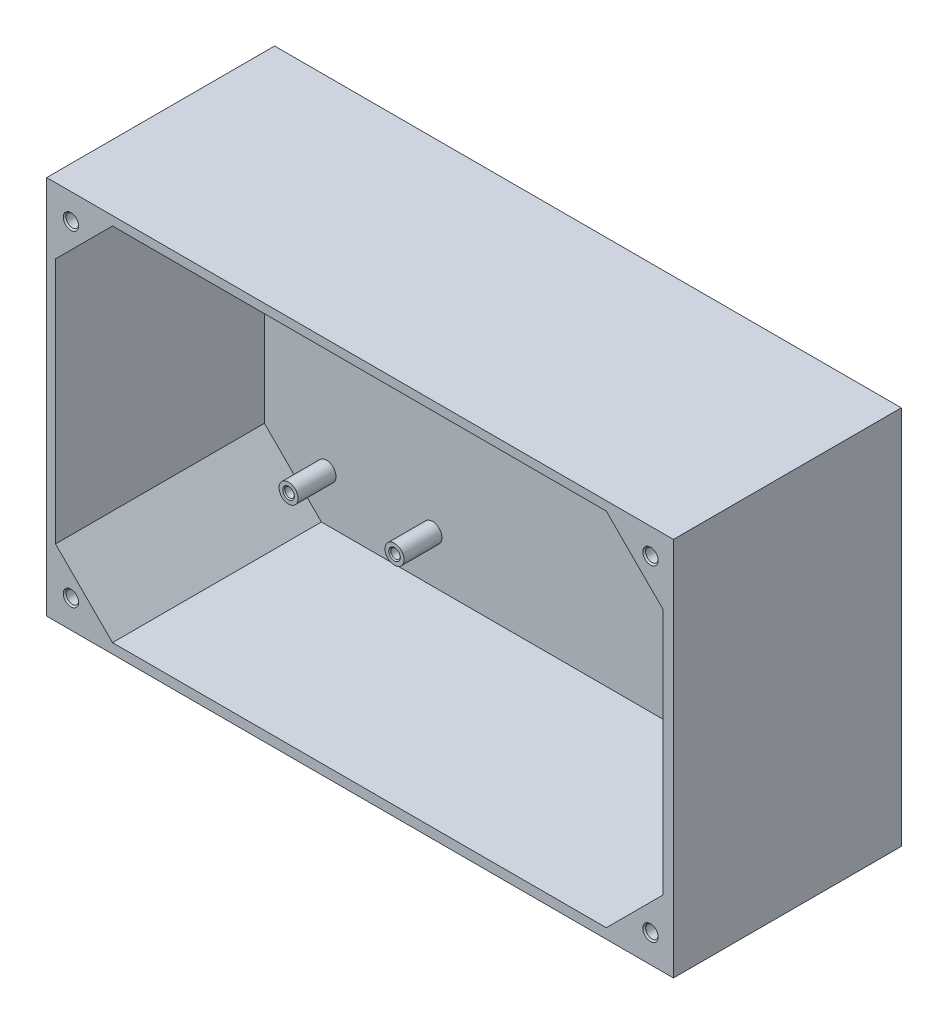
ISO-10303-21;
HEADER;
FILE_DESCRIPTION(('STEP AP214'),'2;1');
FILE_NAME('part.step','',(''),(''),'','','');
FILE_SCHEMA(('AUTOMOTIVE_DESIGN { 1 0 10303 214 1 1 1 1 }'));
ENDSEC;
DATA;
#1=APPLICATION_CONTEXT('core data for automotive mechanical design processes');
#2=APPLICATION_PROTOCOL_DEFINITION('international standard','automotive_design',2000,#1);
#3=PRODUCT_CONTEXT('',#1,'mechanical');
#4=PRODUCT('Part','Part','',(#3));
#5=PRODUCT_RELATED_PRODUCT_CATEGORY('part','',(#4));
#6=PRODUCT_DEFINITION_FORMATION('','',#4);
#7=PRODUCT_DEFINITION_CONTEXT('part definition',#1,'design');
#8=PRODUCT_DEFINITION('design','',#6,#7);
#9=PRODUCT_DEFINITION_SHAPE('','',#8);
#10=(LENGTH_UNIT() NAMED_UNIT(*) SI_UNIT(.MILLI.,.METRE.));
#11=(NAMED_UNIT(*) PLANE_ANGLE_UNIT() SI_UNIT($,.RADIAN.));
#12=(NAMED_UNIT(*) SI_UNIT($,.STERADIAN.) SOLID_ANGLE_UNIT());
#13=UNCERTAINTY_MEASURE_WITH_UNIT(LENGTH_MEASURE(1.E-05),#10,'distance_accuracy_value','');
#14=(GEOMETRIC_REPRESENTATION_CONTEXT(3) GLOBAL_UNCERTAINTY_ASSIGNED_CONTEXT((#13)) GLOBAL_UNIT_ASSIGNED_CONTEXT((#10,
#11,#12)) REPRESENTATION_CONTEXT('',''));
#15=CARTESIAN_POINT('',(0.,0.,0.));
#16=DIRECTION('',(0.,0.,1.));
#17=DIRECTION('',(1.,0.,0.));
#18=AXIS2_PLACEMENT_3D('',#15,#16,#17);
#19=CARTESIAN_POINT('',(96.3762435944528,51.009491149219,5.));
#20=DIRECTION('',(-1.,0.,0.));
#21=DIRECTION('',(0.,0.,1.));
#22=AXIS2_PLACEMENT_3D('',#19,#20,#21);
#23=PLANE('',#22);
#24=DIRECTION('',(0.,-1.,0.));
#25=VECTOR('',#24,1.);
#26=CARTESIAN_POINT('',(96.3762435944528,51.009491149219,5.));
#27=LINE('',#26,#25);
#28=CARTESIAN_POINT('',(96.3762435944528,-0.614404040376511,5.));
#29=VERTEX_POINT('',#28);
#30=CARTESIAN_POINT('',(96.3762435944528,-28.990508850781,5.));
#31=VERTEX_POINT('',#30);
#32=EDGE_CURVE('E444',#29,#31,#27,.T.);
#33=ORIENTED_EDGE('',*,*,#32,.T.);
#34=DIRECTION('',(0.,0.,1.));
#35=VECTOR('',#34,1.);
#36=CARTESIAN_POINT('',(96.3762435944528,-28.990508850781,5.));
#37=LINE('',#36,#35);
#38=CARTESIAN_POINT('',(96.3762435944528,-28.990508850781,60.));
#39=VERTEX_POINT('',#38);
#40=EDGE_CURVE('E541',#31,#39,#37,.T.);
#41=ORIENTED_EDGE('',*,*,#40,.T.);
#42=DIRECTION('',(0.,-1.,0.));
#43=VECTOR('',#42,1.);
#44=CARTESIAN_POINT('',(96.3762435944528,51.009491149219,60.));
#45=LINE('',#44,#43);
#46=CARTESIAN_POINT('',(96.3762435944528,36.009491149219,60.));
#47=VERTEX_POINT('',#46);
#48=EDGE_CURVE('E457',#47,#39,#45,.T.);
#49=ORIENTED_EDGE('',*,*,#48,.F.);
#50=DIRECTION('',(0.,0.,-1.));
#51=VECTOR('',#50,1.);
#52=CARTESIAN_POINT('',(96.3762435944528,36.009491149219,5.));
#53=LINE('',#52,#51);
#54=CARTESIAN_POINT('',(96.3762435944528,36.009491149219,5.));
#55=VERTEX_POINT('',#54);
#56=EDGE_CURVE('E539',#47,#55,#53,.T.);
#57=ORIENTED_EDGE('',*,*,#56,.T.);
#58=CARTESIAN_POINT('',(96.3762435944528,14.9855959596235,5.));
#59=VERTEX_POINT('',#58);
#60=EDGE_CURVE('E446',#55,#59,#27,.T.);
#61=ORIENTED_EDGE('',*,*,#60,.T.);
#62=DIRECTION('',(0.,0.,-1.));
#63=VECTOR('',#62,1.);
#64=CARTESIAN_POINT('',(96.3762435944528,14.9855959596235,25.));
#65=LINE('',#64,#63);
#66=CARTESIAN_POINT('',(96.3762435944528,14.9855959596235,25.));
#67=VERTEX_POINT('',#66);
#68=EDGE_CURVE('E389',#67,#59,#65,.T.);
#69=ORIENTED_EDGE('',*,*,#68,.F.);
#70=DIRECTION('',(0.,1.,0.));
#71=VECTOR('',#70,1.);
#72=CARTESIAN_POINT('',(96.3762435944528,14.9855959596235,25.));
#73=LINE('',#72,#71);
#74=CARTESIAN_POINT('',(96.3762435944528,-0.614404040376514,25.));
#75=VERTEX_POINT('',#74);
#76=EDGE_CURVE('E362',#75,#67,#73,.T.);
#77=ORIENTED_EDGE('',*,*,#76,.F.);
#78=DIRECTION('',(0.,0.,-1.));
#79=VECTOR('',#78,1.);
#80=CARTESIAN_POINT('',(96.3762435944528,-0.614404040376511,25.));
#81=LINE('',#80,#79);
#82=EDGE_CURVE('E373',#75,#29,#81,.T.);
#83=ORIENTED_EDGE('',*,*,#82,.T.);
#84=EDGE_LOOP('',(#33,#41,#49,#57,#61,#69,#77,#83));
#85=FACE_BOUND('',#84,.T.);
#86=ADVANCED_FACE('F56',(#85),#23,.T.);
#87=CARTESIAN_POINT('',(0.,0.,5.));
#88=DIRECTION('',(0.,0.,-1.));
#89=DIRECTION('',(-1.,0.,0.));
#90=AXIS2_PLACEMENT_3D('',#87,#88,#89);
#91=PLANE('',#90);
#92=CARTESIAN_POINT('',(-47.2765943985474,-31.7184657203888,5.));
#93=DIRECTION('',(0.,0.,-1.));
#94=DIRECTION('',(-1.,0.,0.));
#95=AXIS2_PLACEMENT_3D('',#92,#93,#94);
#96=CIRCLE('',#95,2.5);
#97=CARTESIAN_POINT('',(-49.7765943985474,-31.7184657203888,5.));
#98=VERTEX_POINT('',#97);
#99=EDGE_CURVE('E494',#98,#98,#96,.F.);
#100=ORIENTED_EDGE('',*,*,#99,.F.);
#101=EDGE_LOOP('',(#100));
#102=FACE_BOUND('',#101,.T.);
#103=CARTESIAN_POINT('',(-3.60830327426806,19.0815342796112,5.));
#104=DIRECTION('',(0.,0.,-1.));
#105=DIRECTION('',(-1.,0.,0.));
#106=AXIS2_PLACEMENT_3D('',#103,#104,#105);
#107=CIRCLE('',#106,2.5);
#108=CARTESIAN_POINT('',(-6.10830327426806,19.0815342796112,5.));
#109=VERTEX_POINT('',#108);
#110=EDGE_CURVE('E497',#109,#109,#107,.F.);
#111=ORIENTED_EDGE('',*,*,#110,.F.);
#112=EDGE_LOOP('',(#111));
#113=FACE_BOUND('',#112,.T.);
#114=CARTESIAN_POINT('',(-51.8083032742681,19.0815342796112,5.));
#115=DIRECTION('',(0.,0.,-1.));
#116=DIRECTION('',(-1.,0.,0.));
#117=AXIS2_PLACEMENT_3D('',#114,#115,#116);
#118=CIRCLE('',#117,2.5);
#119=CARTESIAN_POINT('',(-54.3083032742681,19.0815342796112,5.));
#120=VERTEX_POINT('',#119);
#121=EDGE_CURVE('E500',#120,#120,#118,.F.);
#122=ORIENTED_EDGE('',*,*,#121,.F.);
#123=EDGE_LOOP('',(#122));
#124=FACE_BOUND('',#123,.T.);
#125=CARTESIAN_POINT('',(-19.3765943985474,-31.7184657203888,5.));
#126=DIRECTION('',(0.,0.,-1.));
#127=DIRECTION('',(-1.,0.,0.));
#128=AXIS2_PLACEMENT_3D('',#125,#126,#127);
#129=CIRCLE('',#128,2.5);
#130=CARTESIAN_POINT('',(-21.8765943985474,-31.7184657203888,5.));
#131=VERTEX_POINT('',#130);
#132=EDGE_CURVE('E503',#131,#131,#129,.F.);
#133=ORIENTED_EDGE('',*,*,#132,.F.);
#134=EDGE_LOOP('',(#133));
#135=FACE_BOUND('',#134,.T.);
#136=DIRECTION('',(0.,-1.,0.));
#137=VECTOR('',#136,1.);
#138=CARTESIAN_POINT('',(-63.6237564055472,51.009491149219,5.));
#139=LINE('',#138,#137);
#140=CARTESIAN_POINT('',(-63.6237564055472,36.009491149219,5.));
#141=VERTEX_POINT('',#140);
#142=CARTESIAN_POINT('',(-63.6237564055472,-28.990508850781,5.));
#143=VERTEX_POINT('',#142);
#144=EDGE_CURVE('E451',#141,#143,#139,.T.);
#145=ORIENTED_EDGE('',*,*,#144,.T.);
#146=DIRECTION('',(-0.707106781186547,0.707106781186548,0.));
#147=VECTOR('',#146,1.);
#148=CARTESIAN_POINT('',(-48.6237564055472,-43.990508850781,5.));
#149=LINE('',#148,#147);
#150=CARTESIAN_POINT('',(-48.6237564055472,-43.990508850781,5.));
#151=VERTEX_POINT('',#150);
#152=EDGE_CURVE('E537',#143,#151,#149,.F.);
#153=ORIENTED_EDGE('',*,*,#152,.T.);
#154=DIRECTION('',(1.,0.,0.));
#155=VECTOR('',#154,1.);
#156=CARTESIAN_POINT('',(-63.6237564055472,-43.990508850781,5.));
#157=LINE('',#156,#155);
#158=CARTESIAN_POINT('',(81.3762435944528,-43.990508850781,5.));
#159=VERTEX_POINT('',#158);
#160=EDGE_CURVE('E441',#151,#159,#157,.T.);
#161=ORIENTED_EDGE('',*,*,#160,.T.);
#162=DIRECTION('',(0.707106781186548,0.707106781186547,0.));
#163=VECTOR('',#162,1.);
#164=CARTESIAN_POINT('',(96.3762435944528,-28.990508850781,5.));
#165=LINE('',#164,#163);
#166=EDGE_CURVE('E535',#159,#31,#165,.T.);
#167=ORIENTED_EDGE('',*,*,#166,.T.);
#168=ORIENTED_EDGE('',*,*,#32,.F.);
#169=DIRECTION('',(1.,0.,0.));
#170=VECTOR('',#169,1.);
#171=CARTESIAN_POINT('',(96.3762435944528,-0.614404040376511,5.));
#172=LINE('',#171,#170);
#173=CARTESIAN_POINT('',(77.1762435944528,-0.614404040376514,5.));
#174=VERTEX_POINT('',#173);
#175=EDGE_CURVE('E366',#174,#29,#172,.T.);
#176=ORIENTED_EDGE('',*,*,#175,.F.);
#177=DIRECTION('',(0.,-1.,0.));
#178=VECTOR('',#177,1.);
#179=CARTESIAN_POINT('',(77.1762435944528,14.9855959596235,5.));
#180=LINE('',#179,#178);
#181=CARTESIAN_POINT('',(77.1762435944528,14.9855959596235,5.));
#182=VERTEX_POINT('',#181);
#183=EDGE_CURVE('E376',#182,#174,#180,.T.);
#184=ORIENTED_EDGE('',*,*,#183,.F.);
#185=DIRECTION('',(-1.,0.,0.));
#186=VECTOR('',#185,1.);
#187=CARTESIAN_POINT('',(96.3762435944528,14.9855959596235,5.));
#188=LINE('',#187,#186);
#189=EDGE_CURVE('E355',#59,#182,#188,.T.);
#190=ORIENTED_EDGE('',*,*,#189,.F.);
#191=ORIENTED_EDGE('',*,*,#60,.F.);
#192=DIRECTION('',(0.707106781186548,-0.707106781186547,0.));
#193=VECTOR('',#192,1.);
#194=CARTESIAN_POINT('',(81.3762435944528,51.009491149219,5.));
#195=LINE('',#194,#193);
#196=CARTESIAN_POINT('',(81.3762435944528,51.009491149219,5.));
#197=VERTEX_POINT('',#196);
#198=EDGE_CURVE('E533',#55,#197,#195,.F.);
#199=ORIENTED_EDGE('',*,*,#198,.T.);
#200=DIRECTION('',(1.,0.,0.));
#201=VECTOR('',#200,1.);
#202=CARTESIAN_POINT('',(-63.6237564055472,51.009491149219,5.));
#203=LINE('',#202,#201);
#204=CARTESIAN_POINT('',(-48.6237564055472,51.009491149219,5.));
#205=VERTEX_POINT('',#204);
#206=EDGE_CURVE('E448',#205,#197,#203,.T.);
#207=ORIENTED_EDGE('',*,*,#206,.F.);
#208=DIRECTION('',(-0.707106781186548,-0.707106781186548,0.));
#209=VECTOR('',#208,1.);
#210=CARTESIAN_POINT('',(-63.6237564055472,36.009491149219,5.));
#211=LINE('',#210,#209);
#212=EDGE_CURVE('E522',#205,#141,#211,.T.);
#213=ORIENTED_EDGE('',*,*,#212,.T.);
#214=EDGE_LOOP('',(#145,#153,#161,#167,#168,#176,#184,#190,#191,#199,#207,#213));
#215=FACE_BOUND('',#214,.T.);
#216=ADVANCED_FACE('F559',(#102,#113,#124,#135,#215),#91,.F.);
#217=CARTESIAN_POINT('',(-65.9482222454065,53.3804373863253,60.));
#218=DIRECTION('',(1.,0.,0.));
#219=DIRECTION('',(0.,0.,-1.));
#220=AXIS2_PLACEMENT_3D('',#217,#218,#219);
#221=PLANE('',#220);
#222=DIRECTION('',(0.,-1.,0.));
#223=VECTOR('',#222,1.);
#224=CARTESIAN_POINT('',(-65.9482222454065,53.3804373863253,0.));
#225=LINE('',#224,#223);
#226=CARTESIAN_POINT('',(-65.9482222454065,53.3804373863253,0.));
#227=VERTEX_POINT('',#226);
#228=CARTESIAN_POINT('',(-65.9482222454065,-46.6195626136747,0.));
#229=VERTEX_POINT('',#228);
#230=EDGE_CURVE('E454',#227,#229,#225,.T.);
#231=ORIENTED_EDGE('',*,*,#230,.T.);
#232=DIRECTION('',(0.,0.,-1.));
#233=VECTOR('',#232,1.);
#234=CARTESIAN_POINT('',(-65.9482222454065,-46.6195626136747,60.));
#235=LINE('',#234,#233);
#236=CARTESIAN_POINT('',(-65.9482222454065,-46.6195626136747,60.));
#237=VERTEX_POINT('',#236);
#238=EDGE_CURVE('E491',#237,#229,#235,.T.);
#239=ORIENTED_EDGE('',*,*,#238,.F.);
#240=DIRECTION('',(0.,-1.,0.));
#241=VECTOR('',#240,1.);
#242=CARTESIAN_POINT('',(-65.9482222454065,53.3804373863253,60.));
#243=LINE('',#242,#241);
#244=CARTESIAN_POINT('',(-65.9482222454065,53.3804373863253,60.));
#245=VERTEX_POINT('',#244);
#246=EDGE_CURVE('E465',#245,#237,#243,.T.);
#247=ORIENTED_EDGE('',*,*,#246,.F.);
#248=DIRECTION('',(0.,0.,-1.));
#249=VECTOR('',#248,1.);
#250=CARTESIAN_POINT('',(-65.9482222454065,53.3804373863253,60.));
#251=LINE('',#250,#249);
#252=EDGE_CURVE('E475',#245,#227,#251,.T.);
#253=ORIENTED_EDGE('',*,*,#252,.T.);
#254=EDGE_LOOP('',(#231,#239,#247,#253));
#255=FACE_BOUND('',#254,.T.);
#256=ADVANCED_FACE('F607',(#255),#221,.F.);
#257=CARTESIAN_POINT('',(-65.9482222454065,-46.6195626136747,60.));
#258=DIRECTION('',(0.,1.,0.));
#259=DIRECTION('',(0.,0.,1.));
#260=AXIS2_PLACEMENT_3D('',#257,#258,#259);
#261=PLANE('',#260);
#262=DIRECTION('',(1.,0.,0.));
#263=VECTOR('',#262,1.);
#264=CARTESIAN_POINT('',(-65.9482222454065,-46.6195626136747,0.));
#265=LINE('',#264,#263);
#266=CARTESIAN_POINT('',(99.0517777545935,-46.6195626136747,0.));
#267=VERTEX_POINT('',#266);
#268=EDGE_CURVE('E478',#229,#267,#265,.T.);
#269=ORIENTED_EDGE('',*,*,#268,.T.);
#270=DIRECTION('',(0.,0.,-1.));
#271=VECTOR('',#270,1.);
#272=CARTESIAN_POINT('',(99.0517777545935,-46.6195626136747,60.));
#273=LINE('',#272,#271);
#274=CARTESIAN_POINT('',(99.0517777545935,-46.6195626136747,60.));
#275=VERTEX_POINT('',#274);
#276=EDGE_CURVE('E488',#275,#267,#273,.T.);
#277=ORIENTED_EDGE('',*,*,#276,.F.);
#278=DIRECTION('',(1.,0.,0.));
#279=VECTOR('',#278,1.);
#280=CARTESIAN_POINT('',(-65.9482222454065,-46.6195626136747,60.));
#281=LINE('',#280,#279);
#282=EDGE_CURVE('E468',#237,#275,#281,.T.);
#283=ORIENTED_EDGE('',*,*,#282,.F.);
#284=ORIENTED_EDGE('',*,*,#238,.T.);
#285=EDGE_LOOP('',(#269,#277,#283,#284));
#286=FACE_BOUND('',#285,.T.);
#287=ADVANCED_FACE('F629',(#286),#261,.F.);
#288=CARTESIAN_POINT('',(99.0517777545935,53.3804373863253,60.));
#289=DIRECTION('',(-1.,0.,0.));
#290=DIRECTION('',(0.,0.,1.));
#291=AXIS2_PLACEMENT_3D('',#288,#289,#290);
#292=PLANE('',#291);
#293=DIRECTION('',(0.,1.,0.));
#294=VECTOR('',#293,1.);
#295=CARTESIAN_POINT('',(99.0517777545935,53.3804373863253,0.));
#296=LINE('',#295,#294);
#297=CARTESIAN_POINT('',(99.0517777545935,53.3804373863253,0.));
#298=VERTEX_POINT('',#297);
#299=EDGE_CURVE('E480',#267,#298,#296,.T.);
#300=ORIENTED_EDGE('',*,*,#299,.T.);
#301=DIRECTION('',(0.,0.,-1.));
#302=VECTOR('',#301,1.);
#303=CARTESIAN_POINT('',(99.0517777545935,53.3804373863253,60.));
#304=LINE('',#303,#302);
#305=CARTESIAN_POINT('',(99.0517777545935,53.3804373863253,60.));
#306=VERTEX_POINT('',#305);
#307=EDGE_CURVE('E485',#306,#298,#304,.T.);
#308=ORIENTED_EDGE('',*,*,#307,.F.);
#309=DIRECTION('',(0.,1.,0.));
#310=VECTOR('',#309,1.);
#311=CARTESIAN_POINT('',(99.0517777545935,53.3804373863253,60.));
#312=LINE('',#311,#310);
#313=EDGE_CURVE('E471',#275,#306,#312,.T.);
#314=ORIENTED_EDGE('',*,*,#313,.F.);
#315=ORIENTED_EDGE('',*,*,#276,.T.);
#316=EDGE_LOOP('',(#300,#308,#314,#315));
#317=FACE_BOUND('',#316,.T.);
#318=ADVANCED_FACE('F625',(#317),#292,.F.);
#319=CARTESIAN_POINT('',(-65.9482222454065,53.3804373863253,60.));
#320=DIRECTION('',(0.,-1.,0.));
#321=DIRECTION('',(0.,0.,-1.));
#322=AXIS2_PLACEMENT_3D('',#319,#320,#321);
#323=PLANE('',#322);
#324=DIRECTION('',(-1.,0.,0.));
#325=VECTOR('',#324,1.);
#326=CARTESIAN_POINT('',(-65.9482222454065,53.3804373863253,0.));
#327=LINE('',#326,#325);
#328=EDGE_CURVE('E469',#298,#227,#327,.T.);
#329=ORIENTED_EDGE('',*,*,#328,.T.);
#330=ORIENTED_EDGE('',*,*,#252,.F.);
#331=DIRECTION('',(-1.,0.,0.));
#332=VECTOR('',#331,1.);
#333=CARTESIAN_POINT('',(-65.9482222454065,53.3804373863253,60.));
#334=LINE('',#333,#332);
#335=EDGE_CURVE('E473',#306,#245,#334,.T.);
#336=ORIENTED_EDGE('',*,*,#335,.F.);
#337=ORIENTED_EDGE('',*,*,#307,.T.);
#338=EDGE_LOOP('',(#329,#330,#336,#337));
#339=FACE_BOUND('',#338,.T.);
#340=ADVANCED_FACE('F618',(#339),#323,.F.);
#341=CARTESIAN_POINT('',(0.,0.,60.));
#342=DIRECTION('',(0.,0.,1.));
#343=DIRECTION('',(1.,0.,0.));
#344=AXIS2_PLACEMENT_3D('',#341,#342,#343);
#345=PLANE('',#344);
#346=CARTESIAN_POINT('',(-59.5644093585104,46.5584538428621,60.));
#347=DIRECTION('',(0.,0.,1.));
#348=DIRECTION('',(1.,0.,0.));
#349=AXIS2_PLACEMENT_3D('',#346,#347,#348);
#350=CIRCLE('',#349,2.025);
#351=CARTESIAN_POINT('',(-57.5394093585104,46.5584538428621,60.));
#352=VERTEX_POINT('',#351);
#353=EDGE_CURVE('E268',#352,#352,#350,.T.);
#354=ORIENTED_EDGE('',*,*,#353,.F.);
#355=EDGE_LOOP('',(#354));
#356=FACE_BOUND('',#355,.T.);
#357=CARTESIAN_POINT('',(93.0092930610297,46.5584538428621,60.));
#358=DIRECTION('',(0.,0.,1.));
#359=DIRECTION('',(1.,0.,0.));
#360=AXIS2_PLACEMENT_3D('',#357,#358,#359);
#361=CIRCLE('',#360,2.025);
#362=CARTESIAN_POINT('',(95.0342930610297,46.5584538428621,60.));
#363=VERTEX_POINT('',#362);
#364=EDGE_CURVE('E261',#363,#363,#361,.T.);
#365=ORIENTED_EDGE('',*,*,#364,.F.);
#366=EDGE_LOOP('',(#365));
#367=FACE_BOUND('',#366,.T.);
#368=CARTESIAN_POINT('',(93.0092930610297,-39.2855867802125,60.));
#369=DIRECTION('',(0.,0.,1.));
#370=DIRECTION('',(1.,0.,0.));
#371=AXIS2_PLACEMENT_3D('',#368,#369,#370);
#372=CIRCLE('',#371,2.025);
#373=CARTESIAN_POINT('',(95.0342930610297,-39.2855867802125,60.));
#374=VERTEX_POINT('',#373);
#375=EDGE_CURVE('E277',#374,#374,#372,.T.);
#376=ORIENTED_EDGE('',*,*,#375,.F.);
#377=EDGE_LOOP('',(#376));
#378=FACE_BOUND('',#377,.T.);
#379=CARTESIAN_POINT('',(-59.5644093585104,-39.2855867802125,60.));
#380=DIRECTION('',(0.,0.,1.));
#381=DIRECTION('',(1.,0.,0.));
#382=AXIS2_PLACEMENT_3D('',#379,#380,#381);
#383=CIRCLE('',#382,2.025);
#384=CARTESIAN_POINT('',(-57.5394093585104,-39.2855867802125,60.));
#385=VERTEX_POINT('',#384);
#386=EDGE_CURVE('E286',#385,#385,#383,.T.);
#387=ORIENTED_EDGE('',*,*,#386,.F.);
#388=EDGE_LOOP('',(#387));
#389=FACE_BOUND('',#388,.T.);
#390=DIRECTION('',(1.,0.,0.));
#391=VECTOR('',#390,1.);
#392=CARTESIAN_POINT('',(-63.6237564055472,-43.990508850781,60.));
#393=LINE('',#392,#391);
#394=CARTESIAN_POINT('',(-48.6237564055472,-43.990508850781,60.));
#395=VERTEX_POINT('',#394);
#396=CARTESIAN_POINT('',(81.3762435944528,-43.990508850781,60.));
#397=VERTEX_POINT('',#396);
#398=EDGE_CURVE('E440',#395,#397,#393,.T.);
#399=ORIENTED_EDGE('',*,*,#398,.F.);
#400=DIRECTION('',(0.707106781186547,-0.707106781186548,0.));
#401=VECTOR('',#400,1.);
#402=CARTESIAN_POINT('',(-48.6237564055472,-43.990508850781,60.));
#403=LINE('',#402,#401);
#404=CARTESIAN_POINT('',(-63.6237564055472,-28.990508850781,60.));
#405=VERTEX_POINT('',#404);
#406=EDGE_CURVE('E545',#395,#405,#403,.F.);
#407=ORIENTED_EDGE('',*,*,#406,.T.);
#408=DIRECTION('',(0.,-1.,0.));
#409=VECTOR('',#408,1.);
#410=CARTESIAN_POINT('',(-63.6237564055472,51.009491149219,60.));
#411=LINE('',#410,#409);
#412=CARTESIAN_POINT('',(-63.6237564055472,36.009491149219,60.));
#413=VERTEX_POINT('',#412);
#414=EDGE_CURVE('E445',#413,#405,#411,.T.);
#415=ORIENTED_EDGE('',*,*,#414,.F.);
#416=DIRECTION('',(0.707106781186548,0.707106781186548,0.));
#417=VECTOR('',#416,1.);
#418=CARTESIAN_POINT('',(-63.6237564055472,36.009491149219,60.));
#419=LINE('',#418,#417);
#420=CARTESIAN_POINT('',(-48.6237564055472,51.009491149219,60.));
#421=VERTEX_POINT('',#420);
#422=EDGE_CURVE('E524',#413,#421,#419,.T.);
#423=ORIENTED_EDGE('',*,*,#422,.T.);
#424=DIRECTION('',(1.,0.,0.));
#425=VECTOR('',#424,1.);
#426=CARTESIAN_POINT('',(-63.6237564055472,51.009491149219,60.));
#427=LINE('',#426,#425);
#428=CARTESIAN_POINT('',(81.3762435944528,51.009491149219,60.));
#429=VERTEX_POINT('',#428);
#430=EDGE_CURVE('E460',#421,#429,#427,.T.);
#431=ORIENTED_EDGE('',*,*,#430,.T.);
#432=DIRECTION('',(-0.707106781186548,0.707106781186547,0.));
#433=VECTOR('',#432,1.);
#434=CARTESIAN_POINT('',(81.3762435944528,51.009491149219,60.));
#435=LINE('',#434,#433);
#436=EDGE_CURVE('E13',#429,#47,#435,.F.);
#437=ORIENTED_EDGE('',*,*,#436,.T.);
#438=ORIENTED_EDGE('',*,*,#48,.T.);
#439=DIRECTION('',(-0.707106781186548,-0.707106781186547,0.));
#440=VECTOR('',#439,1.);
#441=CARTESIAN_POINT('',(96.3762435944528,-28.990508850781,60.));
#442=LINE('',#441,#440);
#443=EDGE_CURVE('E65',#39,#397,#442,.T.);
#444=ORIENTED_EDGE('',*,*,#443,.T.);
#445=EDGE_LOOP('',(#399,#407,#415,#423,#431,#437,#438,#444));
#446=FACE_BOUND('',#445,.T.);
#447=ORIENTED_EDGE('',*,*,#246,.T.);
#448=ORIENTED_EDGE('',*,*,#282,.T.);
#449=ORIENTED_EDGE('',*,*,#313,.T.);
#450=ORIENTED_EDGE('',*,*,#335,.T.);
#451=EDGE_LOOP('',(#447,#448,#449,#450));
#452=FACE_BOUND('',#451,.T.);
#453=ADVANCED_FACE('F548',(#356,#367,#378,#389,#446,#452),#345,.T.);
#454=CARTESIAN_POINT('',(0.,0.,0.));
#455=DIRECTION('',(0.,0.,1.));
#456=DIRECTION('',(1.,0.,0.));
#457=AXIS2_PLACEMENT_3D('',#454,#455,#456);
#458=PLANE('',#457);
#459=ORIENTED_EDGE('',*,*,#230,.F.);
#460=ORIENTED_EDGE('',*,*,#328,.F.);
#461=ORIENTED_EDGE('',*,*,#299,.F.);
#462=ORIENTED_EDGE('',*,*,#268,.F.);
#463=EDGE_LOOP('',(#459,#460,#461,#462));
#464=FACE_BOUND('',#463,.T.);
#465=ADVANCED_FACE('F615',(#464),#458,.F.);
#466=CARTESIAN_POINT('',(-63.6237564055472,-43.990508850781,5.));
#467=DIRECTION('',(0.,-1.,0.));
#468=DIRECTION('',(0.,0.,-1.));
#469=AXIS2_PLACEMENT_3D('',#466,#467,#468);
#470=PLANE('',#469);
#471=ORIENTED_EDGE('',*,*,#160,.F.);
#472=DIRECTION('',(0.,0.,1.));
#473=VECTOR('',#472,1.);
#474=CARTESIAN_POINT('',(-48.6237564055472,-43.990508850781,60.));
#475=LINE('',#474,#473);
#476=EDGE_CURVE('E528',#151,#395,#475,.T.);
#477=ORIENTED_EDGE('',*,*,#476,.T.);
#478=ORIENTED_EDGE('',*,*,#398,.T.);
#479=DIRECTION('',(0.,0.,-1.));
#480=VECTOR('',#479,1.);
#481=CARTESIAN_POINT('',(81.3762435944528,-43.990508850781,5.));
#482=LINE('',#481,#480);
#483=EDGE_CURVE('E526',#397,#159,#482,.T.);
#484=ORIENTED_EDGE('',*,*,#483,.T.);
#485=EDGE_LOOP('',(#471,#477,#478,#484));
#486=FACE_BOUND('',#485,.T.);
#487=ADVANCED_FACE('F553',(#486),#470,.F.);
#488=CARTESIAN_POINT('',(-63.6237564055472,51.009491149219,5.));
#489=DIRECTION('',(-1.,0.,0.));
#490=DIRECTION('',(0.,-1.,0.));
#491=AXIS2_PLACEMENT_3D('',#488,#489,#490);
#492=PLANE('',#491);
#493=ORIENTED_EDGE('',*,*,#414,.T.);
#494=DIRECTION('',(0.,0.,-1.));
#495=VECTOR('',#494,1.);
#496=CARTESIAN_POINT('',(-63.6237564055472,-28.990508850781,5.));
#497=LINE('',#496,#495);
#498=EDGE_CURVE('E531',#405,#143,#497,.T.);
#499=ORIENTED_EDGE('',*,*,#498,.T.);
#500=ORIENTED_EDGE('',*,*,#144,.F.);
#501=DIRECTION('',(0.,0.,1.));
#502=VECTOR('',#501,1.);
#503=CARTESIAN_POINT('',(-63.6237564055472,36.009491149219,5.));
#504=LINE('',#503,#502);
#505=EDGE_CURVE('E517',#141,#413,#504,.T.);
#506=ORIENTED_EDGE('',*,*,#505,.T.);
#507=EDGE_LOOP('',(#493,#499,#500,#506));
#508=FACE_BOUND('',#507,.T.);
#509=ADVANCED_FACE('F588',(#508),#492,.F.);
#510=CARTESIAN_POINT('',(-63.6237564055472,51.009491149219,5.));
#511=DIRECTION('',(0.,-1.,0.));
#512=DIRECTION('',(0.,0.,-1.));
#513=AXIS2_PLACEMENT_3D('',#510,#511,#512);
#514=PLANE('',#513);
#515=ORIENTED_EDGE('',*,*,#206,.T.);
#516=DIRECTION('',(0.,0.,1.));
#517=VECTOR('',#516,1.);
#518=CARTESIAN_POINT('',(81.3762435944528,51.009491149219,60.));
#519=LINE('',#518,#517);
#520=EDGE_CURVE('E543',#197,#429,#519,.T.);
#521=ORIENTED_EDGE('',*,*,#520,.T.);
#522=ORIENTED_EDGE('',*,*,#430,.F.);
#523=DIRECTION('',(0.,0.,-1.));
#524=VECTOR('',#523,1.);
#525=CARTESIAN_POINT('',(-48.6237564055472,51.009491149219,5.));
#526=LINE('',#525,#524);
#527=EDGE_CURVE('E520',#421,#205,#526,.T.);
#528=ORIENTED_EDGE('',*,*,#527,.T.);
#529=EDGE_LOOP('',(#515,#521,#522,#528));
#530=FACE_BOUND('',#529,.T.);
#531=ADVANCED_FACE('F579',(#530),#514,.T.);
#532=CARTESIAN_POINT('',(-47.2765943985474,-31.7184657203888,15.));
#533=DIRECTION('',(0.,0.,-1.));
#534=DIRECTION('',(-1.,0.,0.));
#535=AXIS2_PLACEMENT_3D('',#532,#533,#534);
#536=CYLINDRICAL_SURFACE('',#535,2.5);
#537=CARTESIAN_POINT('',(-47.2765943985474,-31.7184657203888,15.));
#538=DIRECTION('',(0.,0.,1.));
#539=DIRECTION('',(1.,0.,0.));
#540=AXIS2_PLACEMENT_3D('',#537,#538,#539);
#541=CIRCLE('',#540,2.5);
#542=CARTESIAN_POINT('',(-44.7765943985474,-31.7184657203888,15.));
#543=VERTEX_POINT('',#542);
#544=EDGE_CURVE('E437',#543,#543,#541,.T.);
#545=ORIENTED_EDGE('',*,*,#544,.F.);
#546=EDGE_LOOP('',(#545));
#547=FACE_BOUND('',#546,.T.);
#548=ORIENTED_EDGE('',*,*,#99,.T.);
#549=EDGE_LOOP('',(#548));
#550=FACE_BOUND('',#549,.T.);
#551=ADVANCED_FACE('F698',(#547,#550),#536,.T.);
#552=CARTESIAN_POINT('',(-47.2765943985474,-31.7184657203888,15.));
#553=DIRECTION('',(0.,0.,1.));
#554=DIRECTION('',(1.,0.,0.));
#555=AXIS2_PLACEMENT_3D('',#552,#553,#554);
#556=PLANE('',#555);
#557=CARTESIAN_POINT('',(-47.2765943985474,-31.7184657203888,15.));
#558=DIRECTION('',(0.,0.,1.));
#559=DIRECTION('',(1.,0.,0.));
#560=AXIS2_PLACEMENT_3D('',#557,#558,#559);
#561=CIRCLE('',#560,1.525);
#562=CARTESIAN_POINT('',(-45.7515943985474,-31.7184657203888,15.));
#563=VERTEX_POINT('',#562);
#564=EDGE_CURVE('E419',#563,#563,#561,.T.);
#565=ORIENTED_EDGE('',*,*,#564,.F.);
#566=EDGE_LOOP('',(#565));
#567=FACE_BOUND('',#566,.T.);
#568=ORIENTED_EDGE('',*,*,#544,.T.);
#569=EDGE_LOOP('',(#568));
#570=FACE_BOUND('',#569,.T.);
#571=ADVANCED_FACE('F703',(#567,#570),#556,.T.);
#572=CARTESIAN_POINT('',(-3.60830327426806,19.0815342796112,15.));
#573=DIRECTION('',(0.,0.,-1.));
#574=DIRECTION('',(-1.,0.,0.));
#575=AXIS2_PLACEMENT_3D('',#572,#573,#574);
#576=CYLINDRICAL_SURFACE('',#575,2.5);
#577=CARTESIAN_POINT('',(-3.60830327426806,19.0815342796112,15.));
#578=DIRECTION('',(0.,0.,1.));
#579=DIRECTION('',(1.,0.,0.));
#580=AXIS2_PLACEMENT_3D('',#577,#578,#579);
#581=CIRCLE('',#580,2.5);
#582=CARTESIAN_POINT('',(-1.10830327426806,19.0815342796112,15.));
#583=VERTEX_POINT('',#582);
#584=EDGE_CURVE('E434',#583,#583,#581,.T.);
#585=ORIENTED_EDGE('',*,*,#584,.F.);
#586=EDGE_LOOP('',(#585));
#587=FACE_BOUND('',#586,.T.);
#588=ORIENTED_EDGE('',*,*,#110,.T.);
#589=EDGE_LOOP('',(#588));
#590=FACE_BOUND('',#589,.T.);
#591=ADVANCED_FACE('F712',(#587,#590),#576,.T.);
#592=CARTESIAN_POINT('',(-3.60830327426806,19.0815342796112,15.));
#593=DIRECTION('',(0.,0.,1.));
#594=DIRECTION('',(1.,0.,0.));
#595=AXIS2_PLACEMENT_3D('',#592,#593,#594);
#596=PLANE('',#595);
#597=CARTESIAN_POINT('',(-3.60830327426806,19.0815342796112,15.));
#598=DIRECTION('',(0.,0.,1.));
#599=DIRECTION('',(1.,0.,0.));
#600=AXIS2_PLACEMENT_3D('',#597,#598,#599);
#601=CIRCLE('',#600,1.525);
#602=CARTESIAN_POINT('',(-2.08330327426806,19.0815342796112,15.));
#603=VERTEX_POINT('',#602);
#604=EDGE_CURVE('E401',#603,#603,#601,.T.);
#605=ORIENTED_EDGE('',*,*,#604,.F.);
#606=EDGE_LOOP('',(#605));
#607=FACE_BOUND('',#606,.T.);
#608=ORIENTED_EDGE('',*,*,#584,.T.);
#609=EDGE_LOOP('',(#608));
#610=FACE_BOUND('',#609,.T.);
#611=ADVANCED_FACE('F721',(#607,#610),#596,.T.);
#612=CARTESIAN_POINT('',(-51.8083032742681,19.0815342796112,15.));
#613=DIRECTION('',(0.,0.,-1.));
#614=DIRECTION('',(-1.,0.,0.));
#615=AXIS2_PLACEMENT_3D('',#612,#613,#614);
#616=CYLINDRICAL_SURFACE('',#615,2.5);
#617=CARTESIAN_POINT('',(-51.8083032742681,19.0815342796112,15.));
#618=DIRECTION('',(0.,0.,1.));
#619=DIRECTION('',(1.,0.,0.));
#620=AXIS2_PLACEMENT_3D('',#617,#618,#619);
#621=CIRCLE('',#620,2.5);
#622=CARTESIAN_POINT('',(-49.3083032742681,19.0815342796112,15.));
#623=VERTEX_POINT('',#622);
#624=EDGE_CURVE('E431',#623,#623,#621,.T.);
#625=ORIENTED_EDGE('',*,*,#624,.F.);
#626=EDGE_LOOP('',(#625));
#627=FACE_BOUND('',#626,.T.);
#628=ORIENTED_EDGE('',*,*,#121,.T.);
#629=EDGE_LOOP('',(#628));
#630=FACE_BOUND('',#629,.T.);
#631=ADVANCED_FACE('F729',(#627,#630),#616,.T.);
#632=CARTESIAN_POINT('',(-51.8083032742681,19.0815342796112,15.));
#633=DIRECTION('',(0.,0.,1.));
#634=DIRECTION('',(1.,0.,0.));
#635=AXIS2_PLACEMENT_3D('',#632,#633,#634);
#636=PLANE('',#635);
#637=CARTESIAN_POINT('',(-51.8083032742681,19.0815342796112,15.));
#638=DIRECTION('',(0.,0.,1.));
#639=DIRECTION('',(1.,0.,0.));
#640=AXIS2_PLACEMENT_3D('',#637,#638,#639);
#641=CIRCLE('',#640,1.525);
#642=CARTESIAN_POINT('',(-50.2833032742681,19.0815342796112,15.));
#643=VERTEX_POINT('',#642);
#644=EDGE_CURVE('E392',#643,#643,#641,.T.);
#645=ORIENTED_EDGE('',*,*,#644,.F.);
#646=EDGE_LOOP('',(#645));
#647=FACE_BOUND('',#646,.T.);
#648=ORIENTED_EDGE('',*,*,#624,.T.);
#649=EDGE_LOOP('',(#648));
#650=FACE_BOUND('',#649,.T.);
#651=ADVANCED_FACE('F737',(#647,#650),#636,.T.);
#652=CARTESIAN_POINT('',(-19.3765943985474,-31.7184657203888,15.));
#653=DIRECTION('',(0.,0.,-1.));
#654=DIRECTION('',(-1.,0.,0.));
#655=AXIS2_PLACEMENT_3D('',#652,#653,#654);
#656=CYLINDRICAL_SURFACE('',#655,2.5);
#657=CARTESIAN_POINT('',(-19.3765943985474,-31.7184657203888,15.));
#658=DIRECTION('',(0.,0.,1.));
#659=DIRECTION('',(1.,0.,0.));
#660=AXIS2_PLACEMENT_3D('',#657,#658,#659);
#661=CIRCLE('',#660,2.5);
#662=CARTESIAN_POINT('',(-16.8765943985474,-31.7184657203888,15.));
#663=VERTEX_POINT('',#662);
#664=EDGE_CURVE('E428',#663,#663,#661,.T.);
#665=ORIENTED_EDGE('',*,*,#664,.F.);
#666=EDGE_LOOP('',(#665));
#667=FACE_BOUND('',#666,.T.);
#668=ORIENTED_EDGE('',*,*,#132,.T.);
#669=EDGE_LOOP('',(#668));
#670=FACE_BOUND('',#669,.T.);
#671=ADVANCED_FACE('F744',(#667,#670),#656,.T.);
#672=CARTESIAN_POINT('',(-19.3765943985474,-31.7184657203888,15.));
#673=DIRECTION('',(0.,0.,1.));
#674=DIRECTION('',(1.,0.,0.));
#675=AXIS2_PLACEMENT_3D('',#672,#673,#674);
#676=PLANE('',#675);
#677=CARTESIAN_POINT('',(-19.3765943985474,-31.7184657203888,15.));
#678=DIRECTION('',(0.,0.,1.));
#679=DIRECTION('',(1.,0.,0.));
#680=AXIS2_PLACEMENT_3D('',#677,#678,#679);
#681=CIRCLE('',#680,1.525);
#682=CARTESIAN_POINT('',(-17.8515943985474,-31.7184657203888,15.));
#683=VERTEX_POINT('',#682);
#684=EDGE_CURVE('E410',#683,#683,#681,.T.);
#685=ORIENTED_EDGE('',*,*,#684,.F.);
#686=EDGE_LOOP('',(#685));
#687=FACE_BOUND('',#686,.T.);
#688=ORIENTED_EDGE('',*,*,#664,.T.);
#689=EDGE_LOOP('',(#688));
#690=FACE_BOUND('',#689,.T.);
#691=ADVANCED_FACE('F752',(#687,#690),#676,.T.);
#692=CARTESIAN_POINT('',(-47.2765943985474,-31.7184657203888,5.));
#693=DIRECTION('',(0.,0.,1.));
#694=DIRECTION('',(1.,0.,0.));
#695=AXIS2_PLACEMENT_3D('',#692,#693,#694);
#696=CONICAL_SURFACE('',#695,1.24999999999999,1.02974425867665);
#697=CARTESIAN_POINT('',(-47.2765943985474,-31.7184657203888,4.24892422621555));
#698=VERTEX_POINT('',#697);
#699=VERTEX_LOOP('',#698);
#700=FACE_BOUND('',#699,.T.);
#701=CARTESIAN_POINT('',(-47.2765943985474,-31.7184657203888,5.));
#702=DIRECTION('',(0.,0.,1.));
#703=DIRECTION('',(1.,0.,0.));
#704=AXIS2_PLACEMENT_3D('',#701,#702,#703);
#705=CIRCLE('',#704,1.24999999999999);
#706=CARTESIAN_POINT('',(-46.0265943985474,-31.7184657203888,5.));
#707=VERTEX_POINT('',#706);
#708=EDGE_CURVE('E425',#707,#707,#705,.T.);
#709=ORIENTED_EDGE('',*,*,#708,.T.);
#710=EDGE_LOOP('',(#709));
#711=FACE_BOUND('',#710,.T.);
#712=ADVANCED_FACE('F759',(#700,#711),#696,.F.);
#713=CARTESIAN_POINT('',(-47.2765943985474,-31.7184657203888,15.));
#714=DIRECTION('',(0.,0.,1.));
#715=DIRECTION('',(1.,0.,0.));
#716=AXIS2_PLACEMENT_3D('',#713,#714,#715);
#717=CYLINDRICAL_SURFACE('',#716,1.25);
#718=ORIENTED_EDGE('',*,*,#708,.F.);
#719=EDGE_LOOP('',(#718));
#720=FACE_BOUND('',#719,.T.);
#721=CARTESIAN_POINT('',(-47.2765943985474,-31.7184657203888,14.725));
#722=DIRECTION('',(0.,0.,1.));
#723=DIRECTION('',(1.,0.,0.));
#724=AXIS2_PLACEMENT_3D('',#721,#722,#723);
#725=CIRCLE('',#724,1.25);
#726=CARTESIAN_POINT('',(-46.0265943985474,-31.7184657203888,14.725));
#727=VERTEX_POINT('',#726);
#728=EDGE_CURVE('E422',#727,#727,#725,.T.);
#729=ORIENTED_EDGE('',*,*,#728,.T.);
#730=EDGE_LOOP('',(#729));
#731=FACE_BOUND('',#730,.T.);
#732=ADVANCED_FACE('F767',(#720,#731),#717,.F.);
#733=CARTESIAN_POINT('',(-47.2765943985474,-31.7184657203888,15.));
#734=DIRECTION('',(0.,0.,1.));
#735=DIRECTION('',(1.,0.,0.));
#736=AXIS2_PLACEMENT_3D('',#733,#734,#735);
#737=CONICAL_SURFACE('',#736,1.525,0.785398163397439);
#738=ORIENTED_EDGE('',*,*,#728,.F.);
#739=EDGE_LOOP('',(#738));
#740=FACE_BOUND('',#739,.T.);
#741=ORIENTED_EDGE('',*,*,#564,.T.);
#742=EDGE_LOOP('',(#741));
#743=FACE_BOUND('',#742,.T.);
#744=ADVANCED_FACE('F776',(#740,#743),#737,.F.);
#745=CARTESIAN_POINT('',(-19.3765943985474,-31.7184657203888,5.));
#746=DIRECTION('',(0.,0.,1.));
#747=DIRECTION('',(1.,0.,0.));
#748=AXIS2_PLACEMENT_3D('',#745,#746,#747);
#749=CONICAL_SURFACE('',#748,1.25,1.02974425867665);
#750=CARTESIAN_POINT('',(-19.3765943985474,-31.7184657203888,4.24892422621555));
#751=VERTEX_POINT('',#750);
#752=VERTEX_LOOP('',#751);
#753=FACE_BOUND('',#752,.T.);
#754=CARTESIAN_POINT('',(-19.3765943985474,-31.7184657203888,5.));
#755=DIRECTION('',(0.,0.,1.));
#756=DIRECTION('',(1.,0.,0.));
#757=AXIS2_PLACEMENT_3D('',#754,#755,#756);
#758=CIRCLE('',#757,1.25);
#759=CARTESIAN_POINT('',(-18.1265943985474,-31.7184657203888,5.));
#760=VERTEX_POINT('',#759);
#761=EDGE_CURVE('E416',#760,#760,#758,.T.);
#762=ORIENTED_EDGE('',*,*,#761,.T.);
#763=EDGE_LOOP('',(#762));
#764=FACE_BOUND('',#763,.T.);
#765=ADVANCED_FACE('F786',(#753,#764),#749,.F.);
#766=CARTESIAN_POINT('',(-19.3765943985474,-31.7184657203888,15.));
#767=DIRECTION('',(0.,0.,1.));
#768=DIRECTION('',(1.,0.,0.));
#769=AXIS2_PLACEMENT_3D('',#766,#767,#768);
#770=CYLINDRICAL_SURFACE('',#769,1.25);
#771=ORIENTED_EDGE('',*,*,#761,.F.);
#772=EDGE_LOOP('',(#771));
#773=FACE_BOUND('',#772,.T.);
#774=CARTESIAN_POINT('',(-19.3765943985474,-31.7184657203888,14.725));
#775=DIRECTION('',(0.,0.,1.));
#776=DIRECTION('',(1.,0.,0.));
#777=AXIS2_PLACEMENT_3D('',#774,#775,#776);
#778=CIRCLE('',#777,1.25);
#779=CARTESIAN_POINT('',(-18.1265943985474,-31.7184657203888,14.725));
#780=VERTEX_POINT('',#779);
#781=EDGE_CURVE('E413',#780,#780,#778,.T.);
#782=ORIENTED_EDGE('',*,*,#781,.T.);
#783=EDGE_LOOP('',(#782));
#784=FACE_BOUND('',#783,.T.);
#785=ADVANCED_FACE('F795',(#773,#784),#770,.F.);
#786=CARTESIAN_POINT('',(-19.3765943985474,-31.7184657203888,15.));
#787=DIRECTION('',(0.,0.,1.));
#788=DIRECTION('',(1.,0.,0.));
#789=AXIS2_PLACEMENT_3D('',#786,#787,#788);
#790=CONICAL_SURFACE('',#789,1.525,0.785398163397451);
#791=ORIENTED_EDGE('',*,*,#781,.F.);
#792=EDGE_LOOP('',(#791));
#793=FACE_BOUND('',#792,.T.);
#794=ORIENTED_EDGE('',*,*,#684,.T.);
#795=EDGE_LOOP('',(#794));
#796=FACE_BOUND('',#795,.T.);
#797=ADVANCED_FACE('F803',(#793,#796),#790,.F.);
#798=CARTESIAN_POINT('',(-3.60830327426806,19.0815342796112,5.));
#799=DIRECTION('',(0.,0.,1.));
#800=DIRECTION('',(1.,0.,0.));
#801=AXIS2_PLACEMENT_3D('',#798,#799,#800);
#802=CONICAL_SURFACE('',#801,1.25,1.02974425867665);
#803=CARTESIAN_POINT('',(-3.60830327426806,19.0815342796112,4.24892422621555));
#804=VERTEX_POINT('',#803);
#805=VERTEX_LOOP('',#804);
#806=FACE_BOUND('',#805,.T.);
#807=CARTESIAN_POINT('',(-3.60830327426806,19.0815342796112,5.));
#808=DIRECTION('',(0.,0.,1.));
#809=DIRECTION('',(1.,0.,0.));
#810=AXIS2_PLACEMENT_3D('',#807,#808,#809);
#811=CIRCLE('',#810,1.25);
#812=CARTESIAN_POINT('',(-2.35830327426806,19.0815342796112,5.));
#813=VERTEX_POINT('',#812);
#814=EDGE_CURVE('E407',#813,#813,#811,.T.);
#815=ORIENTED_EDGE('',*,*,#814,.T.);
#816=EDGE_LOOP('',(#815));
#817=FACE_BOUND('',#816,.T.);
#818=ADVANCED_FACE('F811',(#806,#817),#802,.F.);
#819=CARTESIAN_POINT('',(-3.60830327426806,19.0815342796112,15.));
#820=DIRECTION('',(0.,0.,1.));
#821=DIRECTION('',(1.,0.,0.));
#822=AXIS2_PLACEMENT_3D('',#819,#820,#821);
#823=CYLINDRICAL_SURFACE('',#822,1.25);
#824=ORIENTED_EDGE('',*,*,#814,.F.);
#825=EDGE_LOOP('',(#824));
#826=FACE_BOUND('',#825,.T.);
#827=CARTESIAN_POINT('',(-3.60830327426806,19.0815342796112,14.725));
#828=DIRECTION('',(0.,0.,1.));
#829=DIRECTION('',(1.,0.,0.));
#830=AXIS2_PLACEMENT_3D('',#827,#828,#829);
#831=CIRCLE('',#830,1.25);
#832=CARTESIAN_POINT('',(-2.35830327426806,19.0815342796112,14.725));
#833=VERTEX_POINT('',#832);
#834=EDGE_CURVE('E404',#833,#833,#831,.T.);
#835=ORIENTED_EDGE('',*,*,#834,.T.);
#836=EDGE_LOOP('',(#835));
#837=FACE_BOUND('',#836,.T.);
#838=ADVANCED_FACE('F820',(#826,#837),#823,.F.);
#839=CARTESIAN_POINT('',(-3.60830327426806,19.0815342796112,15.));
#840=DIRECTION('',(0.,0.,1.));
#841=DIRECTION('',(1.,0.,0.));
#842=AXIS2_PLACEMENT_3D('',#839,#840,#841);
#843=CONICAL_SURFACE('',#842,1.525,0.785398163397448);
#844=ORIENTED_EDGE('',*,*,#834,.F.);
#845=EDGE_LOOP('',(#844));
#846=FACE_BOUND('',#845,.T.);
#847=ORIENTED_EDGE('',*,*,#604,.T.);
#848=EDGE_LOOP('',(#847));
#849=FACE_BOUND('',#848,.T.);
#850=ADVANCED_FACE('F828',(#846,#849),#843,.F.);
#851=CARTESIAN_POINT('',(-51.8083032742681,19.0815342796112,5.));
#852=DIRECTION('',(0.,0.,1.));
#853=DIRECTION('',(1.,0.,0.));
#854=AXIS2_PLACEMENT_3D('',#851,#852,#853);
#855=CONICAL_SURFACE('',#854,1.24999999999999,1.02974425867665);
#856=CARTESIAN_POINT('',(-51.8083032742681,19.0815342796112,4.24892422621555));
#857=VERTEX_POINT('',#856);
#858=VERTEX_LOOP('',#857);
#859=FACE_BOUND('',#858,.T.);
#860=CARTESIAN_POINT('',(-51.8083032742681,19.0815342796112,5.));
#861=DIRECTION('',(0.,0.,1.));
#862=DIRECTION('',(1.,0.,0.));
#863=AXIS2_PLACEMENT_3D('',#860,#861,#862);
#864=CIRCLE('',#863,1.24999999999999);
#865=CARTESIAN_POINT('',(-50.5583032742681,19.0815342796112,5.));
#866=VERTEX_POINT('',#865);
#867=EDGE_CURVE('E398',#866,#866,#864,.T.);
#868=ORIENTED_EDGE('',*,*,#867,.T.);
#869=EDGE_LOOP('',(#868));
#870=FACE_BOUND('',#869,.T.);
#871=ADVANCED_FACE('F836',(#859,#870),#855,.F.);
#872=CARTESIAN_POINT('',(-51.8083032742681,19.0815342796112,15.));
#873=DIRECTION('',(0.,0.,1.));
#874=DIRECTION('',(1.,0.,0.));
#875=AXIS2_PLACEMENT_3D('',#872,#873,#874);
#876=CYLINDRICAL_SURFACE('',#875,1.25);
#877=ORIENTED_EDGE('',*,*,#867,.F.);
#878=EDGE_LOOP('',(#877));
#879=FACE_BOUND('',#878,.T.);
#880=CARTESIAN_POINT('',(-51.8083032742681,19.0815342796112,14.725));
#881=DIRECTION('',(0.,0.,1.));
#882=DIRECTION('',(1.,0.,0.));
#883=AXIS2_PLACEMENT_3D('',#880,#881,#882);
#884=CIRCLE('',#883,1.25);
#885=CARTESIAN_POINT('',(-50.5583032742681,19.0815342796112,14.725));
#886=VERTEX_POINT('',#885);
#887=EDGE_CURVE('E395',#886,#886,#884,.T.);
#888=ORIENTED_EDGE('',*,*,#887,.T.);
#889=EDGE_LOOP('',(#888));
#890=FACE_BOUND('',#889,.T.);
#891=ADVANCED_FACE('F845',(#879,#890),#876,.F.);
#892=CARTESIAN_POINT('',(-51.8083032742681,19.0815342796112,15.));
#893=DIRECTION('',(0.,0.,1.));
#894=DIRECTION('',(1.,0.,0.));
#895=AXIS2_PLACEMENT_3D('',#892,#893,#894);
#896=CONICAL_SURFACE('',#895,1.525,0.785398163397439);
#897=ORIENTED_EDGE('',*,*,#887,.F.);
#898=EDGE_LOOP('',(#897));
#899=FACE_BOUND('',#898,.T.);
#900=ORIENTED_EDGE('',*,*,#644,.T.);
#901=EDGE_LOOP('',(#900));
#902=FACE_BOUND('',#901,.T.);
#903=ADVANCED_FACE('F853',(#899,#902),#896,.F.);
#904=CARTESIAN_POINT('',(96.3762435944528,14.9855959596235,25.));
#905=DIRECTION('',(0.,-1.,0.));
#906=DIRECTION('',(1.,0.,0.));
#907=AXIS2_PLACEMENT_3D('',#904,#905,#906);
#908=PLANE('',#907);
#909=ORIENTED_EDGE('',*,*,#189,.T.);
#910=DIRECTION('',(0.,0.,-1.));
#911=VECTOR('',#910,1.);
#912=CARTESIAN_POINT('',(77.1762435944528,14.9855959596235,25.));
#913=LINE('',#912,#911);
#914=CARTESIAN_POINT('',(77.1762435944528,14.9855959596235,25.));
#915=VERTEX_POINT('',#914);
#916=EDGE_CURVE('E386',#915,#182,#913,.T.);
#917=ORIENTED_EDGE('',*,*,#916,.F.);
#918=DIRECTION('',(-1.,0.,0.));
#919=VECTOR('',#918,1.);
#920=CARTESIAN_POINT('',(96.3762435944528,14.9855959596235,25.));
#921=LINE('',#920,#919);
#922=EDGE_CURVE('E365',#67,#915,#921,.T.);
#923=ORIENTED_EDGE('',*,*,#922,.F.);
#924=ORIENTED_EDGE('',*,*,#68,.T.);
#925=EDGE_LOOP('',(#909,#917,#923,#924));
#926=FACE_BOUND('',#925,.T.);
#927=ADVANCED_FACE('F573',(#926),#908,.F.);
#928=CARTESIAN_POINT('',(77.1762435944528,14.9855959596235,25.));
#929=DIRECTION('',(1.,0.,0.));
#930=DIRECTION('',(0.,0.,-1.));
#931=AXIS2_PLACEMENT_3D('',#928,#929,#930);
#932=PLANE('',#931);
#933=DIRECTION('',(0.,0.,1.));
#934=VECTOR('',#933,1.);
#935=CARTESIAN_POINT('',(77.1762435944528,0.396859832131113,5.75394937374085));
#936=LINE('',#935,#934);
#937=CARTESIAN_POINT('',(77.1762435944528,0.396859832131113,5.75394937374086));
#938=VERTEX_POINT('',#937);
#939=CARTESIAN_POINT('',(77.1762435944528,0.396859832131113,8.83818761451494));
#940=VERTEX_POINT('',#939);
#941=EDGE_CURVE('E306',#938,#940,#936,.T.);
#942=ORIENTED_EDGE('',*,*,#941,.F.);
#943=DIRECTION('',(0.,-1.,0.));
#944=VECTOR('',#943,1.);
#945=CARTESIAN_POINT('',(77.1762435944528,14.0528763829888,5.75394937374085));
#946=LINE('',#945,#944);
#947=CARTESIAN_POINT('',(77.1762435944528,14.0528763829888,5.75394937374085));
#948=VERTEX_POINT('',#947);
#949=EDGE_CURVE('E295',#948,#938,#946,.T.);
#950=ORIENTED_EDGE('',*,*,#949,.F.);
#951=DIRECTION('',(0.,0.,-1.));
#952=VECTOR('',#951,1.);
#953=CARTESIAN_POINT('',(77.1762435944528,14.0528763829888,5.75394937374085));
#954=LINE('',#953,#952);
#955=CARTESIAN_POINT('',(77.1762435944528,14.0528763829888,8.83818761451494));
#956=VERTEX_POINT('',#955);
#957=EDGE_CURVE('E300',#956,#948,#954,.T.);
#958=ORIENTED_EDGE('',*,*,#957,.F.);
#959=DIRECTION('',(0.,1.,0.));
#960=VECTOR('',#959,1.);
#961=CARTESIAN_POINT('',(77.1762435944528,14.0528763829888,8.83818761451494));
#962=LINE('',#961,#960);
#963=EDGE_CURVE('E309',#940,#956,#962,.T.);
#964=ORIENTED_EDGE('',*,*,#963,.F.);
#965=EDGE_LOOP('',(#942,#950,#958,#964));
#966=FACE_BOUND('',#965,.T.);
#967=ORIENTED_EDGE('',*,*,#183,.T.);
#968=DIRECTION('',(0.,0.,-1.));
#969=VECTOR('',#968,1.);
#970=CARTESIAN_POINT('',(77.1762435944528,-0.614404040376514,25.));
#971=LINE('',#970,#969);
#972=CARTESIAN_POINT('',(77.1762435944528,-0.614404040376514,25.));
#973=VERTEX_POINT('',#972);
#974=EDGE_CURVE('E383',#973,#174,#971,.T.);
#975=ORIENTED_EDGE('',*,*,#974,.F.);
#976=DIRECTION('',(0.,-1.,0.));
#977=VECTOR('',#976,1.);
#978=CARTESIAN_POINT('',(77.1762435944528,14.9855959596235,25.));
#979=LINE('',#978,#977);
#980=EDGE_CURVE('E368',#915,#973,#979,.T.);
#981=ORIENTED_EDGE('',*,*,#980,.F.);
#982=ORIENTED_EDGE('',*,*,#916,.T.);
#983=EDGE_LOOP('',(#967,#975,#981,#982));
#984=FACE_BOUND('',#983,.T.);
#985=ADVANCED_FACE('F568',(#966,#984),#932,.F.);
#986=CARTESIAN_POINT('',(96.3762435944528,-0.614404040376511,25.));
#987=DIRECTION('',(0.,1.,0.));
#988=DIRECTION('',(-1.,0.,0.));
#989=AXIS2_PLACEMENT_3D('',#986,#987,#988);
#990=PLANE('',#989);
#991=ORIENTED_EDGE('',*,*,#175,.T.);
#992=ORIENTED_EDGE('',*,*,#82,.F.);
#993=DIRECTION('',(1.,0.,0.));
#994=VECTOR('',#993,1.);
#995=CARTESIAN_POINT('',(96.3762435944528,-0.614404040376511,25.));
#996=LINE('',#995,#994);
#997=EDGE_CURVE('E370',#973,#75,#996,.T.);
#998=ORIENTED_EDGE('',*,*,#997,.F.);
#999=ORIENTED_EDGE('',*,*,#974,.T.);
#1000=EDGE_LOOP('',(#991,#992,#998,#999));
#1001=FACE_BOUND('',#1000,.T.);
#1002=ADVANCED_FACE('F564',(#1001),#990,.F.);
#1003=CARTESIAN_POINT('',(0.,0.,25.));
#1004=DIRECTION('',(0.,0.,-1.));
#1005=DIRECTION('',(-1.,0.,0.));
#1006=AXIS2_PLACEMENT_3D('',#1003,#1004,#1005);
#1007=PLANE('',#1006);
#1008=DIRECTION('',(1.,0.,0.));
#1009=VECTOR('',#1008,1.);
#1010=CARTESIAN_POINT('',(77.7341247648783,0.,25.));
#1011=LINE('',#1010,#1009);
#1012=CARTESIAN_POINT('',(77.7341247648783,0.,25.));
#1013=VERTEX_POINT('',#1012);
#1014=CARTESIAN_POINT('',(95.7774884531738,0.,25.));
#1015=VERTEX_POINT('',#1014);
#1016=EDGE_CURVE('E344',#1013,#1015,#1011,.T.);
#1017=ORIENTED_EDGE('',*,*,#1016,.F.);
#1018=DIRECTION('',(0.,-1.,0.));
#1019=VECTOR('',#1018,1.);
#1020=CARTESIAN_POINT('',(77.7341247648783,14.5046243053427,25.));
#1021=LINE('',#1020,#1019);
#1022=CARTESIAN_POINT('',(77.7341247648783,14.5046243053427,25.));
#1023=VERTEX_POINT('',#1022);
#1024=EDGE_CURVE('E328',#1023,#1013,#1021,.T.);
#1025=ORIENTED_EDGE('',*,*,#1024,.F.);
#1026=DIRECTION('',(-1.,0.,0.));
#1027=VECTOR('',#1026,1.);
#1028=CARTESIAN_POINT('',(77.7341247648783,14.5046243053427,25.));
#1029=LINE('',#1028,#1027);
#1030=CARTESIAN_POINT('',(95.7774884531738,14.5046243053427,25.));
#1031=VERTEX_POINT('',#1030);
#1032=EDGE_CURVE('E350',#1031,#1023,#1029,.T.);
#1033=ORIENTED_EDGE('',*,*,#1032,.F.);
#1034=DIRECTION('',(0.,1.,0.));
#1035=VECTOR('',#1034,1.);
#1036=CARTESIAN_POINT('',(95.7774884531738,14.5046243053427,25.));
#1037=LINE('',#1036,#1035);
#1038=EDGE_CURVE('E347',#1015,#1031,#1037,.T.);
#1039=ORIENTED_EDGE('',*,*,#1038,.F.);
#1040=EDGE_LOOP('',(#1017,#1025,#1033,#1039));
#1041=FACE_BOUND('',#1040,.T.);
#1042=ORIENTED_EDGE('',*,*,#76,.T.);
#1043=ORIENTED_EDGE('',*,*,#922,.T.);
#1044=ORIENTED_EDGE('',*,*,#980,.T.);
#1045=ORIENTED_EDGE('',*,*,#997,.T.);
#1046=EDGE_LOOP('',(#1042,#1043,#1044,#1045));
#1047=FACE_BOUND('',#1046,.T.);
#1048=ADVANCED_FACE('F882',(#1041,#1047),#1007,.F.);
#1049=CARTESIAN_POINT('',(77.7341247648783,14.5046243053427,8.00000000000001));
#1050=DIRECTION('',(-1.,0.,0.));
#1051=DIRECTION('',(0.,0.,1.));
#1052=AXIS2_PLACEMENT_3D('',#1049,#1050,#1051);
#1053=PLANE('',#1052);
#1054=DIRECTION('',(0.,1.,0.));
#1055=VECTOR('',#1054,1.);
#1056=CARTESIAN_POINT('',(77.7341247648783,14.5046243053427,8.83818761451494));
#1057=LINE('',#1056,#1055);
#1058=CARTESIAN_POINT('',(77.7341247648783,0.396859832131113,8.83818761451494));
#1059=VERTEX_POINT('',#1058);
#1060=CARTESIAN_POINT('',(77.7341247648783,14.0528763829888,8.83818761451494));
#1061=VERTEX_POINT('',#1060);
#1062=EDGE_CURVE('E514',#1059,#1061,#1057,.T.);
#1063=ORIENTED_EDGE('',*,*,#1062,.T.);
#1064=DIRECTION('',(0.,0.,-1.));
#1065=VECTOR('',#1064,1.);
#1066=CARTESIAN_POINT('',(77.7341247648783,14.0528763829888,8.00000000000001));
#1067=LINE('',#1066,#1065);
#1068=CARTESIAN_POINT('',(77.7341247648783,14.0528763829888,8.00000000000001));
#1069=VERTEX_POINT('',#1068);
#1070=EDGE_CURVE('E325',#1061,#1069,#1067,.T.);
#1071=ORIENTED_EDGE('',*,*,#1070,.T.);
#1072=DIRECTION('',(0.,-1.,0.));
#1073=VECTOR('',#1072,1.);
#1074=CARTESIAN_POINT('',(77.7341247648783,14.5046243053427,8.00000000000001));
#1075=LINE('',#1074,#1073);
#1076=CARTESIAN_POINT('',(77.7341247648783,14.5046243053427,8.00000000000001));
#1077=VERTEX_POINT('',#1076);
#1078=EDGE_CURVE('E329',#1077,#1069,#1075,.T.);
#1079=ORIENTED_EDGE('',*,*,#1078,.F.);
#1080=DIRECTION('',(0.,0.,1.));
#1081=VECTOR('',#1080,1.);
#1082=CARTESIAN_POINT('',(77.7341247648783,14.5046243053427,8.00000000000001));
#1083=LINE('',#1082,#1081);
#1084=EDGE_CURVE('E353',#1077,#1023,#1083,.T.);
#1085=ORIENTED_EDGE('',*,*,#1084,.T.);
#1086=ORIENTED_EDGE('',*,*,#1024,.T.);
#1087=DIRECTION('',(0.,0.,1.));
#1088=VECTOR('',#1087,1.);
#1089=CARTESIAN_POINT('',(77.7341247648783,0.,8.00000000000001));
#1090=LINE('',#1089,#1088);
#1091=CARTESIAN_POINT('',(77.7341247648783,0.,8.00000000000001));
#1092=VERTEX_POINT('',#1091);
#1093=EDGE_CURVE('E342',#1092,#1013,#1090,.T.);
#1094=ORIENTED_EDGE('',*,*,#1093,.F.);
#1095=CARTESIAN_POINT('',(77.7341247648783,0.396859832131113,8.00000000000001));
#1096=VERTEX_POINT('',#1095);
#1097=EDGE_CURVE('E333',#1096,#1092,#1075,.T.);
#1098=ORIENTED_EDGE('',*,*,#1097,.F.);
#1099=DIRECTION('',(0.,0.,1.));
#1100=VECTOR('',#1099,1.);
#1101=CARTESIAN_POINT('',(77.7341247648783,0.396859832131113,8.00000000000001));
#1102=LINE('',#1101,#1100);
#1103=EDGE_CURVE('E316',#1096,#1059,#1102,.T.);
#1104=ORIENTED_EDGE('',*,*,#1103,.T.);
#1105=EDGE_LOOP('',(#1063,#1071,#1079,#1085,#1086,#1094,#1098,#1104));
#1106=FACE_BOUND('',#1105,.T.);
#1107=ADVANCED_FACE('F889',(#1106),#1053,.F.);
#1108=CARTESIAN_POINT('',(77.7341247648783,14.5046243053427,8.00000000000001));
#1109=DIRECTION('',(0.,1.,0.));
#1110=DIRECTION('',(0.,0.,1.));
#1111=AXIS2_PLACEMENT_3D('',#1108,#1109,#1110);
#1112=PLANE('',#1111);
#1113=ORIENTED_EDGE('',*,*,#1032,.T.);
#1114=ORIENTED_EDGE('',*,*,#1084,.F.);
#1115=DIRECTION('',(-1.,0.,0.));
#1116=VECTOR('',#1115,1.);
#1117=CARTESIAN_POINT('',(77.7341247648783,14.5046243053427,8.00000000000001));
#1118=LINE('',#1117,#1116);
#1119=CARTESIAN_POINT('',(95.7774884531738,14.5046243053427,8.00000000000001));
#1120=VERTEX_POINT('',#1119);
#1121=EDGE_CURVE('E339',#1120,#1077,#1118,.T.);
#1122=ORIENTED_EDGE('',*,*,#1121,.F.);
#1123=DIRECTION('',(0.,0.,1.));
#1124=VECTOR('',#1123,1.);
#1125=CARTESIAN_POINT('',(95.7774884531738,14.5046243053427,8.00000000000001));
#1126=LINE('',#1125,#1124);
#1127=EDGE_CURVE('E356',#1120,#1031,#1126,.T.);
#1128=ORIENTED_EDGE('',*,*,#1127,.T.);
#1129=EDGE_LOOP('',(#1113,#1114,#1122,#1128));
#1130=FACE_BOUND('',#1129,.T.);
#1131=ADVANCED_FACE('F897',(#1130),#1112,.F.);
#1132=CARTESIAN_POINT('',(95.7774884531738,14.5046243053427,8.00000000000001));
#1133=DIRECTION('',(1.,0.,0.));
#1134=DIRECTION('',(0.,0.,-1.));
#1135=AXIS2_PLACEMENT_3D('',#1132,#1133,#1134);
#1136=PLANE('',#1135);
#1137=ORIENTED_EDGE('',*,*,#1038,.T.);
#1138=ORIENTED_EDGE('',*,*,#1127,.F.);
#1139=DIRECTION('',(0.,1.,0.));
#1140=VECTOR('',#1139,1.);
#1141=CARTESIAN_POINT('',(95.7774884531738,14.5046243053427,8.00000000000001));
#1142=LINE('',#1141,#1140);
#1143=CARTESIAN_POINT('',(95.7774884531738,0.,8.00000000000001));
#1144=VERTEX_POINT('',#1143);
#1145=EDGE_CURVE('E336',#1144,#1120,#1142,.T.);
#1146=ORIENTED_EDGE('',*,*,#1145,.F.);
#1147=DIRECTION('',(0.,0.,1.));
#1148=VECTOR('',#1147,1.);
#1149=CARTESIAN_POINT('',(95.7774884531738,0.,8.00000000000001));
#1150=LINE('',#1149,#1148);
#1151=EDGE_CURVE('E358',#1144,#1015,#1150,.T.);
#1152=ORIENTED_EDGE('',*,*,#1151,.T.);
#1153=EDGE_LOOP('',(#1137,#1138,#1146,#1152));
#1154=FACE_BOUND('',#1153,.T.);
#1155=ADVANCED_FACE('F905',(#1154),#1136,.F.);
#1156=CARTESIAN_POINT('',(77.7341247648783,0.,8.00000000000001));
#1157=DIRECTION('',(0.,-1.,0.));
#1158=DIRECTION('',(0.,0.,-1.));
#1159=AXIS2_PLACEMENT_3D('',#1156,#1157,#1158);
#1160=PLANE('',#1159);
#1161=ORIENTED_EDGE('',*,*,#1016,.T.);
#1162=ORIENTED_EDGE('',*,*,#1151,.F.);
#1163=DIRECTION('',(1.,0.,0.));
#1164=VECTOR('',#1163,1.);
#1165=CARTESIAN_POINT('',(77.7341247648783,0.,8.00000000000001));
#1166=LINE('',#1165,#1164);
#1167=EDGE_CURVE('E332',#1092,#1144,#1166,.T.);
#1168=ORIENTED_EDGE('',*,*,#1167,.F.);
#1169=ORIENTED_EDGE('',*,*,#1093,.T.);
#1170=EDGE_LOOP('',(#1161,#1162,#1168,#1169));
#1171=FACE_BOUND('',#1170,.T.);
#1172=ADVANCED_FACE('F913',(#1171),#1160,.F.);
#1173=CARTESIAN_POINT('',(0.,0.,8.00000000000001));
#1174=DIRECTION('',(0.,0.,1.));
#1175=DIRECTION('',(1.,0.,0.));
#1176=AXIS2_PLACEMENT_3D('',#1173,#1174,#1175);
#1177=PLANE('',#1176);
#1178=DIRECTION('',(-1.,0.,0.));
#1179=VECTOR('',#1178,1.);
#1180=CARTESIAN_POINT('',(0.,14.0528763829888,8.00000000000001));
#1181=LINE('',#1180,#1179);
#1182=CARTESIAN_POINT('',(95.1762435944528,14.0528763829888,8.00000000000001));
#1183=VERTEX_POINT('',#1182);
#1184=EDGE_CURVE('E512',#1183,#1069,#1181,.T.);
#1185=ORIENTED_EDGE('',*,*,#1184,.F.);
#1186=DIRECTION('',(0.,-1.,0.));
#1187=VECTOR('',#1186,1.);
#1188=CARTESIAN_POINT('',(95.1762435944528,0.,8.00000000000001));
#1189=LINE('',#1188,#1187);
#1190=CARTESIAN_POINT('',(95.1762435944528,0.396859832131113,8.00000000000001));
#1191=VERTEX_POINT('',#1190);
#1192=EDGE_CURVE('E506',#1183,#1191,#1189,.T.);
#1193=ORIENTED_EDGE('',*,*,#1192,.T.);
#1194=DIRECTION('',(1.,0.,0.));
#1195=VECTOR('',#1194,1.);
#1196=CARTESIAN_POINT('',(0.,0.396859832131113,8.00000000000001));
#1197=LINE('',#1196,#1195);
#1198=EDGE_CURVE('E509',#1096,#1191,#1197,.T.);
#1199=ORIENTED_EDGE('',*,*,#1198,.F.);
#1200=ORIENTED_EDGE('',*,*,#1097,.T.);
#1201=ORIENTED_EDGE('',*,*,#1167,.T.);
#1202=ORIENTED_EDGE('',*,*,#1145,.T.);
#1203=ORIENTED_EDGE('',*,*,#1121,.T.);
#1204=ORIENTED_EDGE('',*,*,#1078,.T.);
#1205=EDGE_LOOP('',(#1185,#1193,#1199,#1200,#1201,#1202,#1203,#1204));
#1206=FACE_BOUND('',#1205,.T.);
#1207=ADVANCED_FACE('F920',(#1206),#1177,.T.);
#1208=CARTESIAN_POINT('',(95.1762435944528,14.0528763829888,8.83818761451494));
#1209=DIRECTION('',(0.,0.,1.));
#1210=DIRECTION('',(1.,0.,0.));
#1211=AXIS2_PLACEMENT_3D('',#1208,#1209,#1210);
#1212=PLANE('',#1211);
#1213=DIRECTION('',(-1.,0.,0.));
#1214=VECTOR('',#1213,1.);
#1215=CARTESIAN_POINT('',(95.1762435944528,0.396859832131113,8.83818761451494));
#1216=LINE('',#1215,#1214);
#1217=EDGE_CURVE('E319',#1059,#940,#1216,.T.);
#1218=ORIENTED_EDGE('',*,*,#1217,.T.);
#1219=ORIENTED_EDGE('',*,*,#963,.T.);
#1220=DIRECTION('',(-1.,0.,0.));
#1221=VECTOR('',#1220,1.);
#1222=CARTESIAN_POINT('',(95.1762435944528,14.0528763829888,8.83818761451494));
#1223=LINE('',#1222,#1221);
#1224=EDGE_CURVE('E317',#1061,#956,#1223,.T.);
#1225=ORIENTED_EDGE('',*,*,#1224,.F.);
#1226=ORIENTED_EDGE('',*,*,#1062,.F.);
#1227=EDGE_LOOP('',(#1218,#1219,#1225,#1226));
#1228=FACE_BOUND('',#1227,.T.);
#1229=ADVANCED_FACE('F927',(#1228),#1212,.F.);
#1230=CARTESIAN_POINT('',(95.1762435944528,14.0528763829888,5.75394937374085));
#1231=DIRECTION('',(0.,1.,0.));
#1232=DIRECTION('',(0.,0.,1.));
#1233=AXIS2_PLACEMENT_3D('',#1230,#1231,#1232);
#1234=PLANE('',#1233);
#1235=ORIENTED_EDGE('',*,*,#1224,.T.);
#1236=ORIENTED_EDGE('',*,*,#957,.T.);
#1237=DIRECTION('',(-1.,0.,0.));
#1238=VECTOR('',#1237,1.);
#1239=CARTESIAN_POINT('',(95.1762435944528,14.0528763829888,5.75394937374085));
#1240=LINE('',#1239,#1238);
#1241=CARTESIAN_POINT('',(95.1762435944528,14.0528763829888,5.75394937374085));
#1242=VERTEX_POINT('',#1241);
#1243=EDGE_CURVE('E314',#1242,#948,#1240,.T.);
#1244=ORIENTED_EDGE('',*,*,#1243,.F.);
#1245=DIRECTION('',(0.,0.,-1.));
#1246=VECTOR('',#1245,1.);
#1247=CARTESIAN_POINT('',(95.1762435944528,14.0528763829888,5.75394937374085));
#1248=LINE('',#1247,#1246);
#1249=EDGE_CURVE('E302',#1183,#1242,#1248,.T.);
#1250=ORIENTED_EDGE('',*,*,#1249,.F.);
#1251=ORIENTED_EDGE('',*,*,#1184,.T.);
#1252=ORIENTED_EDGE('',*,*,#1070,.F.);
#1253=EDGE_LOOP('',(#1235,#1236,#1244,#1250,#1251,#1252));
#1254=FACE_BOUND('',#1253,.T.);
#1255=ADVANCED_FACE('F935',(#1254),#1234,.F.);
#1256=CARTESIAN_POINT('',(95.1762435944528,0.396859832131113,5.75394937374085));
#1257=DIRECTION('',(0.,-1.,0.));
#1258=DIRECTION('',(0.,0.,-1.));
#1259=AXIS2_PLACEMENT_3D('',#1256,#1257,#1258);
#1260=PLANE('',#1259);
#1261=ORIENTED_EDGE('',*,*,#1198,.T.);
#1262=DIRECTION('',(0.,0.,1.));
#1263=VECTOR('',#1262,1.);
#1264=CARTESIAN_POINT('',(95.1762435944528,0.396859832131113,5.75394937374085));
#1265=LINE('',#1264,#1263);
#1266=CARTESIAN_POINT('',(95.1762435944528,0.396859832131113,5.75394937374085));
#1267=VERTEX_POINT('',#1266);
#1268=EDGE_CURVE('E299',#1267,#1191,#1265,.T.);
#1269=ORIENTED_EDGE('',*,*,#1268,.F.);
#1270=DIRECTION('',(-1.,0.,0.));
#1271=VECTOR('',#1270,1.);
#1272=CARTESIAN_POINT('',(95.1762435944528,0.396859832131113,5.75394937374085));
#1273=LINE('',#1272,#1271);
#1274=EDGE_CURVE('E304',#1267,#938,#1273,.T.);
#1275=ORIENTED_EDGE('',*,*,#1274,.T.);
#1276=ORIENTED_EDGE('',*,*,#941,.T.);
#1277=ORIENTED_EDGE('',*,*,#1217,.F.);
#1278=ORIENTED_EDGE('',*,*,#1103,.F.);
#1279=EDGE_LOOP('',(#1261,#1269,#1275,#1276,#1277,#1278));
#1280=FACE_BOUND('',#1279,.T.);
#1281=ADVANCED_FACE('F943',(#1280),#1260,.F.);
#1282=CARTESIAN_POINT('',(95.1762435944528,14.0528763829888,5.75394937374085));
#1283=DIRECTION('',(0.,0.,-1.));
#1284=DIRECTION('',(-1.,0.,0.));
#1285=AXIS2_PLACEMENT_3D('',#1282,#1283,#1284);
#1286=PLANE('',#1285);
#1287=ORIENTED_EDGE('',*,*,#949,.T.);
#1288=ORIENTED_EDGE('',*,*,#1274,.F.);
#1289=DIRECTION('',(0.,-1.,0.));
#1290=VECTOR('',#1289,1.);
#1291=CARTESIAN_POINT('',(95.1762435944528,14.0528763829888,5.75394937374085));
#1292=LINE('',#1291,#1290);
#1293=EDGE_CURVE('E296',#1242,#1267,#1292,.T.);
#1294=ORIENTED_EDGE('',*,*,#1293,.F.);
#1295=ORIENTED_EDGE('',*,*,#1243,.T.);
#1296=EDGE_LOOP('',(#1287,#1288,#1294,#1295));
#1297=FACE_BOUND('',#1296,.T.);
#1298=ADVANCED_FACE('F951',(#1297),#1286,.F.);
#1299=CARTESIAN_POINT('',(95.1762435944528,0.,0.));
#1300=DIRECTION('',(-1.,0.,0.));
#1301=DIRECTION('',(0.,0.,1.));
#1302=AXIS2_PLACEMENT_3D('',#1299,#1300,#1301);
#1303=PLANE('',#1302);
#1304=ORIENTED_EDGE('',*,*,#1249,.T.);
#1305=ORIENTED_EDGE('',*,*,#1293,.T.);
#1306=ORIENTED_EDGE('',*,*,#1268,.T.);
#1307=ORIENTED_EDGE('',*,*,#1192,.F.);
#1308=EDGE_LOOP('',(#1304,#1305,#1306,#1307));
#1309=FACE_BOUND('',#1308,.T.);
#1310=ADVANCED_FACE('F599',(#1309),#1303,.T.);
#1311=CARTESIAN_POINT('',(-63.6237564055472,36.009491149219,5.));
#1312=DIRECTION('',(-0.707106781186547,0.707106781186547,0.));
#1313=DIRECTION('',(0.,0.,1.));
#1314=AXIS2_PLACEMENT_3D('',#1311,#1312,#1313);
#1315=PLANE('',#1314);
#1316=ORIENTED_EDGE('',*,*,#212,.F.);
#1317=ORIENTED_EDGE('',*,*,#527,.F.);
#1318=ORIENTED_EDGE('',*,*,#422,.F.);
#1319=ORIENTED_EDGE('',*,*,#505,.F.);
#1320=EDGE_LOOP('',(#1316,#1317,#1318,#1319));
#1321=FACE_BOUND('',#1320,.T.);
#1322=ADVANCED_FACE('F585',(#1321),#1315,.F.);
#1323=CARTESIAN_POINT('',(-48.6237564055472,-43.990508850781,5.));
#1324=DIRECTION('',(0.707106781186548,0.707106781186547,0.));
#1325=DIRECTION('',(0.,0.,-1.));
#1326=AXIS2_PLACEMENT_3D('',#1323,#1324,#1325);
#1327=PLANE('',#1326);
#1328=ORIENTED_EDGE('',*,*,#152,.F.);
#1329=ORIENTED_EDGE('',*,*,#498,.F.);
#1330=ORIENTED_EDGE('',*,*,#406,.F.);
#1331=ORIENTED_EDGE('',*,*,#476,.F.);
#1332=EDGE_LOOP('',(#1328,#1329,#1330,#1331));
#1333=FACE_BOUND('',#1332,.T.);
#1334=ADVANCED_FACE('F592',(#1333),#1327,.T.);
#1335=CARTESIAN_POINT('',(96.3762435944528,-28.990508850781,5.));
#1336=DIRECTION('',(0.707106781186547,-0.707106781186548,0.));
#1337=DIRECTION('',(0.,0.,1.));
#1338=AXIS2_PLACEMENT_3D('',#1335,#1336,#1337);
#1339=PLANE('',#1338);
#1340=ORIENTED_EDGE('',*,*,#166,.F.);
#1341=ORIENTED_EDGE('',*,*,#483,.F.);
#1342=ORIENTED_EDGE('',*,*,#443,.F.);
#1343=ORIENTED_EDGE('',*,*,#40,.F.);
#1344=EDGE_LOOP('',(#1340,#1341,#1342,#1343));
#1345=FACE_BOUND('',#1344,.T.);
#1346=ADVANCED_FACE('F556',(#1345),#1339,.F.);
#1347=CARTESIAN_POINT('',(81.3762435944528,51.009491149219,5.));
#1348=DIRECTION('',(-0.707106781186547,-0.707106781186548,0.));
#1349=DIRECTION('',(0.,0.,-1.));
#1350=AXIS2_PLACEMENT_3D('',#1347,#1348,#1349);
#1351=PLANE('',#1350);
#1352=ORIENTED_EDGE('',*,*,#198,.F.);
#1353=ORIENTED_EDGE('',*,*,#56,.F.);
#1354=ORIENTED_EDGE('',*,*,#436,.F.);
#1355=ORIENTED_EDGE('',*,*,#520,.F.);
#1356=EDGE_LOOP('',(#1352,#1353,#1354,#1355));
#1357=FACE_BOUND('',#1356,.T.);
#1358=ADVANCED_FACE('F59',(#1357),#1351,.T.);
#1359=CARTESIAN_POINT('',(-59.5644093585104,-39.2855867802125,5.));
#1360=DIRECTION('',(0.,0.,1.));
#1361=DIRECTION('',(1.,0.,0.));
#1362=AXIS2_PLACEMENT_3D('',#1359,#1360,#1361);
#1363=CONICAL_SURFACE('',#1362,1.64999999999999,1.02974425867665);
#1364=CARTESIAN_POINT('',(-59.5644093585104,-39.2855867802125,4.00857997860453));
#1365=VERTEX_POINT('',#1364);
#1366=VERTEX_LOOP('',#1365);
#1367=FACE_BOUND('',#1366,.T.);
#1368=CARTESIAN_POINT('',(-59.5644093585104,-39.2855867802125,5.));
#1369=DIRECTION('',(0.,0.,1.));
#1370=DIRECTION('',(1.,0.,0.));
#1371=AXIS2_PLACEMENT_3D('',#1368,#1369,#1370);
#1372=CIRCLE('',#1371,1.64999999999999);
#1373=CARTESIAN_POINT('',(-57.9144093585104,-39.2855867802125,5.));
#1374=VERTEX_POINT('',#1373);
#1375=EDGE_CURVE('E292',#1374,#1374,#1372,.T.);
#1376=ORIENTED_EDGE('',*,*,#1375,.T.);
#1377=EDGE_LOOP('',(#1376));
#1378=FACE_BOUND('',#1377,.T.);
#1379=ADVANCED_FACE('F1149',(#1367,#1378),#1363,.F.);
#1380=CARTESIAN_POINT('',(-59.5644093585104,-39.2855867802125,60.));
#1381=DIRECTION('',(0.,0.,1.));
#1382=DIRECTION('',(1.,0.,0.));
#1383=AXIS2_PLACEMENT_3D('',#1380,#1381,#1382);
#1384=CYLINDRICAL_SURFACE('',#1383,1.65);
#1385=ORIENTED_EDGE('',*,*,#1375,.F.);
#1386=EDGE_LOOP('',(#1385));
#1387=FACE_BOUND('',#1386,.T.);
#1388=CARTESIAN_POINT('',(-59.5644093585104,-39.2855867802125,59.625));
#1389=DIRECTION('',(0.,0.,1.));
#1390=DIRECTION('',(1.,0.,0.));
#1391=AXIS2_PLACEMENT_3D('',#1388,#1389,#1390);
#1392=CIRCLE('',#1391,1.65);
#1393=CARTESIAN_POINT('',(-57.9144093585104,-39.2855867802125,59.625));
#1394=VERTEX_POINT('',#1393);
#1395=EDGE_CURVE('E289',#1394,#1394,#1392,.T.);
#1396=ORIENTED_EDGE('',*,*,#1395,.T.);
#1397=EDGE_LOOP('',(#1396));
#1398=FACE_BOUND('',#1397,.T.);
#1399=ADVANCED_FACE('F1143',(#1387,#1398),#1384,.F.);
#1400=CARTESIAN_POINT('',(-59.5644093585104,-39.2855867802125,60.));
#1401=DIRECTION('',(0.,0.,1.));
#1402=DIRECTION('',(1.,0.,0.));
#1403=AXIS2_PLACEMENT_3D('',#1400,#1401,#1402);
#1404=CONICAL_SURFACE('',#1403,2.025,0.785398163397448);
#1405=ORIENTED_EDGE('',*,*,#1395,.F.);
#1406=EDGE_LOOP('',(#1405));
#1407=FACE_BOUND('',#1406,.T.);
#1408=ORIENTED_EDGE('',*,*,#386,.T.);
#1409=EDGE_LOOP('',(#1408));
#1410=FACE_BOUND('',#1409,.T.);
#1411=ADVANCED_FACE('F1148',(#1407,#1410),#1404,.F.);
#1412=CARTESIAN_POINT('',(93.0092930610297,-39.2855867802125,5.));
#1413=DIRECTION('',(0.,0.,1.));
#1414=DIRECTION('',(1.,0.,0.));
#1415=AXIS2_PLACEMENT_3D('',#1412,#1413,#1414);
#1416=CONICAL_SURFACE('',#1415,1.64999999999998,1.02974425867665);
#1417=CARTESIAN_POINT('',(93.0092930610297,-39.2855867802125,4.00857997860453));
#1418=VERTEX_POINT('',#1417);
#1419=VERTEX_LOOP('',#1418);
#1420=FACE_BOUND('',#1419,.T.);
#1421=CARTESIAN_POINT('',(93.0092930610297,-39.2855867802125,5.));
#1422=DIRECTION('',(0.,0.,1.));
#1423=DIRECTION('',(1.,0.,0.));
#1424=AXIS2_PLACEMENT_3D('',#1421,#1422,#1423);
#1425=CIRCLE('',#1424,1.64999999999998);
#1426=CARTESIAN_POINT('',(94.6592930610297,-39.2855867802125,5.));
#1427=VERTEX_POINT('',#1426);
#1428=EDGE_CURVE('E283',#1427,#1427,#1425,.T.);
#1429=ORIENTED_EDGE('',*,*,#1428,.T.);
#1430=EDGE_LOOP('',(#1429));
#1431=FACE_BOUND('',#1430,.T.);
#1432=ADVANCED_FACE('F1161',(#1420,#1431),#1416,.F.);
#1433=CARTESIAN_POINT('',(93.0092930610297,-39.2855867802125,60.));
#1434=DIRECTION('',(0.,0.,1.));
#1435=DIRECTION('',(1.,0.,0.));
#1436=AXIS2_PLACEMENT_3D('',#1433,#1434,#1435);
#1437=CYLINDRICAL_SURFACE('',#1436,1.64999999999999);
#1438=ORIENTED_EDGE('',*,*,#1428,.F.);
#1439=EDGE_LOOP('',(#1438));
#1440=FACE_BOUND('',#1439,.T.);
#1441=CARTESIAN_POINT('',(93.0092930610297,-39.2855867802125,59.625));
#1442=DIRECTION('',(0.,0.,1.));
#1443=DIRECTION('',(1.,0.,0.));
#1444=AXIS2_PLACEMENT_3D('',#1441,#1442,#1443);
#1445=CIRCLE('',#1444,1.65);
#1446=CARTESIAN_POINT('',(94.6592930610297,-39.2855867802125,59.625));
#1447=VERTEX_POINT('',#1446);
#1448=EDGE_CURVE('E280',#1447,#1447,#1445,.T.);
#1449=ORIENTED_EDGE('',*,*,#1448,.T.);
#1450=EDGE_LOOP('',(#1449));
#1451=FACE_BOUND('',#1450,.T.);
#1452=ADVANCED_FACE('F1175',(#1440,#1451),#1437,.F.);
#1453=CARTESIAN_POINT('',(93.0092930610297,-39.2855867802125,60.));
#1454=DIRECTION('',(0.,0.,1.));
#1455=DIRECTION('',(1.,0.,0.));
#1456=AXIS2_PLACEMENT_3D('',#1453,#1454,#1455);
#1457=CONICAL_SURFACE('',#1456,2.025,0.785398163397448);
#1458=ORIENTED_EDGE('',*,*,#1448,.F.);
#1459=EDGE_LOOP('',(#1458));
#1460=FACE_BOUND('',#1459,.T.);
#1461=ORIENTED_EDGE('',*,*,#375,.T.);
#1462=EDGE_LOOP('',(#1461));
#1463=FACE_BOUND('',#1462,.T.);
#1464=ADVANCED_FACE('F1178',(#1460,#1463),#1457,.F.);
#1465=CARTESIAN_POINT('',(93.0092930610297,46.5584538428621,5.));
#1466=DIRECTION('',(0.,0.,1.));
#1467=DIRECTION('',(1.,0.,0.));
#1468=AXIS2_PLACEMENT_3D('',#1465,#1466,#1467);
#1469=CONICAL_SURFACE('',#1468,1.64999999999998,1.02974425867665);
#1470=CARTESIAN_POINT('',(93.0092930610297,46.5584538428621,4.00857997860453));
#1471=VERTEX_POINT('',#1470);
#1472=VERTEX_LOOP('',#1471);
#1473=FACE_BOUND('',#1472,.T.);
#1474=CARTESIAN_POINT('',(93.0092930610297,46.5584538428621,5.));
#1475=DIRECTION('',(0.,0.,1.));
#1476=DIRECTION('',(1.,0.,0.));
#1477=AXIS2_PLACEMENT_3D('',#1474,#1475,#1476);
#1478=CIRCLE('',#1477,1.64999999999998);
#1479=CARTESIAN_POINT('',(94.6592930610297,46.5584538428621,5.));
#1480=VERTEX_POINT('',#1479);
#1481=EDGE_CURVE('E274',#1480,#1480,#1478,.T.);
#1482=ORIENTED_EDGE('',*,*,#1481,.T.);
#1483=EDGE_LOOP('',(#1482));
#1484=FACE_BOUND('',#1483,.T.);
#1485=ADVANCED_FACE('F1189',(#1473,#1484),#1469,.F.);
#1486=CARTESIAN_POINT('',(93.0092930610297,46.5584538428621,60.));
#1487=DIRECTION('',(0.,0.,1.));
#1488=DIRECTION('',(1.,0.,0.));
#1489=AXIS2_PLACEMENT_3D('',#1486,#1487,#1488);
#1490=CYLINDRICAL_SURFACE('',#1489,1.64999999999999);
#1491=ORIENTED_EDGE('',*,*,#1481,.F.);
#1492=EDGE_LOOP('',(#1491));
#1493=FACE_BOUND('',#1492,.T.);
#1494=CARTESIAN_POINT('',(93.0092930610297,46.5584538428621,59.625));
#1495=DIRECTION('',(0.,0.,1.));
#1496=DIRECTION('',(1.,0.,0.));
#1497=AXIS2_PLACEMENT_3D('',#1494,#1495,#1496);
#1498=CIRCLE('',#1497,1.65);
#1499=CARTESIAN_POINT('',(94.6592930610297,46.5584538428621,59.625));
#1500=VERTEX_POINT('',#1499);
#1501=EDGE_CURVE('E265',#1500,#1500,#1498,.T.);
#1502=ORIENTED_EDGE('',*,*,#1501,.T.);
#1503=EDGE_LOOP('',(#1502));
#1504=FACE_BOUND('',#1503,.T.);
#1505=ADVANCED_FACE('F1201',(#1493,#1504),#1490,.F.);
#1506=CARTESIAN_POINT('',(93.0092930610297,46.5584538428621,60.));
#1507=DIRECTION('',(0.,0.,1.));
#1508=DIRECTION('',(1.,0.,0.));
#1509=AXIS2_PLACEMENT_3D('',#1506,#1507,#1508);
#1510=CONICAL_SURFACE('',#1509,2.025,0.785398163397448);
#1511=ORIENTED_EDGE('',*,*,#1501,.F.);
#1512=EDGE_LOOP('',(#1511));
#1513=FACE_BOUND('',#1512,.T.);
#1514=ORIENTED_EDGE('',*,*,#364,.T.);
#1515=EDGE_LOOP('',(#1514));
#1516=FACE_BOUND('',#1515,.T.);
#1517=ADVANCED_FACE('F255',(#1513,#1516),#1510,.F.);
#1518=CARTESIAN_POINT('',(-59.5644093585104,46.5584538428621,5.));
#1519=DIRECTION('',(0.,0.,1.));
#1520=DIRECTION('',(1.,0.,0.));
#1521=AXIS2_PLACEMENT_3D('',#1518,#1519,#1520);
#1522=CONICAL_SURFACE('',#1521,1.64999999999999,1.02974425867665);
#1523=CARTESIAN_POINT('',(-59.5644093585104,46.5584538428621,4.00857997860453));
#1524=VERTEX_POINT('',#1523);
#1525=VERTEX_LOOP('',#1524);
#1526=FACE_BOUND('',#1525,.T.);
#1527=CARTESIAN_POINT('',(-59.5644093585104,46.5584538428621,5.));
#1528=DIRECTION('',(0.,0.,1.));
#1529=DIRECTION('',(1.,0.,0.));
#1530=AXIS2_PLACEMENT_3D('',#1527,#1528,#1529);
#1531=CIRCLE('',#1530,1.64999999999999);
#1532=CARTESIAN_POINT('',(-57.9144093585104,46.5584538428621,5.));
#1533=VERTEX_POINT('',#1532);
#1534=EDGE_CURVE('E259',#1533,#1533,#1531,.T.);
#1535=ORIENTED_EDGE('',*,*,#1534,.T.);
#1536=EDGE_LOOP('',(#1535));
#1537=FACE_BOUND('',#1536,.T.);
#1538=ADVANCED_FACE('F251',(#1526,#1537),#1522,.F.);
#1539=CARTESIAN_POINT('',(-59.5644093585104,46.5584538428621,60.));
#1540=DIRECTION('',(0.,0.,1.));
#1541=DIRECTION('',(1.,0.,0.));
#1542=AXIS2_PLACEMENT_3D('',#1539,#1540,#1541);
#1543=CYLINDRICAL_SURFACE('',#1542,1.65);
#1544=ORIENTED_EDGE('',*,*,#1534,.F.);
#1545=EDGE_LOOP('',(#1544));
#1546=FACE_BOUND('',#1545,.T.);
#1547=CARTESIAN_POINT('',(-59.5644093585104,46.5584538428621,59.625));
#1548=DIRECTION('',(0.,0.,1.));
#1549=DIRECTION('',(1.,0.,0.));
#1550=AXIS2_PLACEMENT_3D('',#1547,#1548,#1549);
#1551=CIRCLE('',#1550,1.65);
#1552=CARTESIAN_POINT('',(-57.9144093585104,46.5584538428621,59.625));
#1553=VERTEX_POINT('',#1552);
#1554=EDGE_CURVE('E262',#1553,#1553,#1551,.T.);
#1555=ORIENTED_EDGE('',*,*,#1554,.T.);
#1556=EDGE_LOOP('',(#1555));
#1557=FACE_BOUND('',#1556,.T.);
#1558=ADVANCED_FACE('F254',(#1546,#1557),#1543,.F.);
#1559=CARTESIAN_POINT('',(-59.5644093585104,46.5584538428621,60.));
#1560=DIRECTION('',(0.,0.,1.));
#1561=DIRECTION('',(1.,0.,0.));
#1562=AXIS2_PLACEMENT_3D('',#1559,#1560,#1561);
#1563=CONICAL_SURFACE('',#1562,2.025,0.785398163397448);
#1564=ORIENTED_EDGE('',*,*,#1554,.F.);
#1565=EDGE_LOOP('',(#1564));
#1566=FACE_BOUND('',#1565,.T.);
#1567=ORIENTED_EDGE('',*,*,#353,.T.);
#1568=EDGE_LOOP('',(#1567));
#1569=FACE_BOUND('',#1568,.T.);
#1570=ADVANCED_FACE('F1126',(#1566,#1569),#1563,.F.);
#1571=CLOSED_SHELL('',(#86,#216,#256,#287,#318,#340,#453,#465,#487,#509,#531,#551,#571,#591,
#611,#631,#651,#671,#691,#712,#732,#744,#765,#785,#797,#818,#838,#850,#871,#891,#903,#927,#985,
#1002,#1048,#1107,#1131,#1155,#1172,#1207,#1229,#1255,#1281,#1298,#1310,#1322,#1334,#1346,#1358,
#1379,#1399,#1411,#1432,#1452,#1464,#1485,#1505,#1517,#1538,#1558,#1570));
#1572=MANIFOLD_SOLID_BREP('B2',#1571);
#1573=ADVANCED_BREP_SHAPE_REPRESENTATION('',(#18,#1572),#14);
#1574=SHAPE_DEFINITION_REPRESENTATION(#9,#1573);
ENDSEC;
END-ISO-10303-21;
